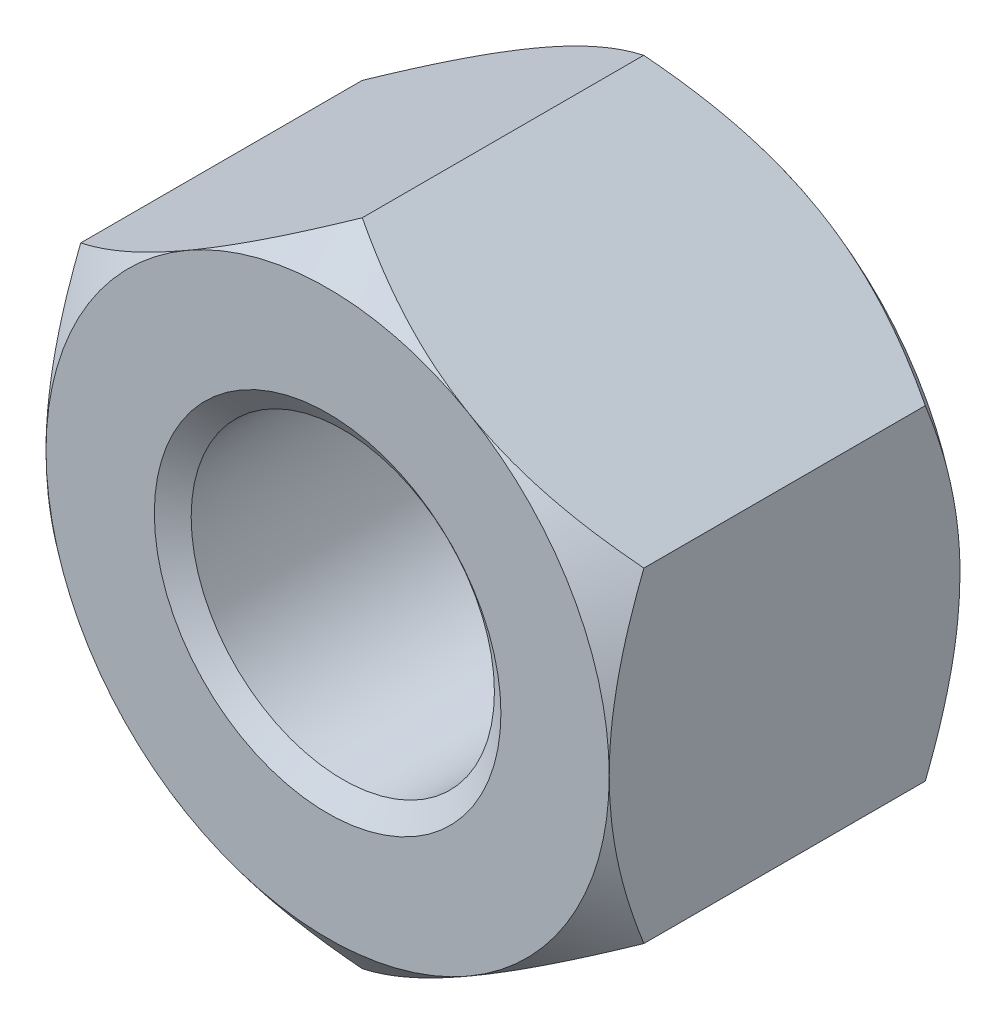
ISO-10303-21;
HEADER;
FILE_DESCRIPTION(('STEP AP214'),'2;1');
FILE_NAME('part.step','',(''),(''),'','','');
FILE_SCHEMA(('AUTOMOTIVE_DESIGN { 1 0 10303 214 1 1 1 1 }'));
ENDSEC;
DATA;
#1=APPLICATION_CONTEXT('core data for automotive mechanical design processes');
#2=APPLICATION_PROTOCOL_DEFINITION('international standard','automotive_design',2000,#1);
#3=PRODUCT_CONTEXT('',#1,'mechanical');
#4=PRODUCT('Part','Part','',(#3));
#5=PRODUCT_RELATED_PRODUCT_CATEGORY('part','',(#4));
#6=PRODUCT_DEFINITION_FORMATION('','',#4);
#7=PRODUCT_DEFINITION_CONTEXT('part definition',#1,'design');
#8=PRODUCT_DEFINITION('design','',#6,#7);
#9=PRODUCT_DEFINITION_SHAPE('','',#8);
#10=(LENGTH_UNIT() NAMED_UNIT(*) SI_UNIT(.MILLI.,.METRE.));
#11=(NAMED_UNIT(*) PLANE_ANGLE_UNIT() SI_UNIT($,.RADIAN.));
#12=(NAMED_UNIT(*) SI_UNIT($,.STERADIAN.) SOLID_ANGLE_UNIT());
#13=UNCERTAINTY_MEASURE_WITH_UNIT(LENGTH_MEASURE(1.E-05),#10,'distance_accuracy_value','');
#14=(GEOMETRIC_REPRESENTATION_CONTEXT(3) GLOBAL_UNCERTAINTY_ASSIGNED_CONTEXT((#13)) GLOBAL_UNIT_ASSIGNED_CONTEXT((#10,
#11,#12)) REPRESENTATION_CONTEXT('',''));
#15=CARTESIAN_POINT('',(0.,0.,0.));
#16=DIRECTION('',(0.,0.,1.));
#17=DIRECTION('',(1.,0.,0.));
#18=AXIS2_PLACEMENT_3D('',#15,#16,#17);
#19=CARTESIAN_POINT('',(0.,0.,-25.7048));
#20=DIRECTION('',(0.,0.,1.));
#21=DIRECTION('',(1.,0.,0.));
#22=AXIS2_PLACEMENT_3D('',#19,#20,#21);
#23=CYLINDRICAL_SURFACE('',#22,11.1125);
#24=CARTESIAN_POINT('',(0.,0.,-1.11157946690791));
#25=DIRECTION('',(0.,0.,1.));
#26=DIRECTION('',(1.,0.,0.));
#27=AXIS2_PLACEMENT_3D('',#24,#25,#26);
#28=CIRCLE('',#27,11.1125);
#29=CARTESIAN_POINT('',(11.1125,0.,-1.11157946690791));
#30=VERTEX_POINT('',#29);
#31=EDGE_CURVE('E180',#30,#30,#28,.F.);
#32=ORIENTED_EDGE('',*,*,#31,.F.);
#33=EDGE_LOOP('',(#32));
#34=FACE_BOUND('',#33,.T.);
#35=CARTESIAN_POINT('',(0.,0.,-24.5678205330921));
#36=DIRECTION('',(0.,0.,-1.));
#37=DIRECTION('',(-1.,0.,0.));
#38=AXIS2_PLACEMENT_3D('',#35,#36,#37);
#39=CIRCLE('',#38,11.1125);
#40=CARTESIAN_POINT('',(-11.1125,0.,-24.5678205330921));
#41=VERTEX_POINT('',#40);
#42=EDGE_CURVE('E44',#41,#41,#39,.F.);
#43=ORIENTED_EDGE('',*,*,#42,.F.);
#44=EDGE_LOOP('',(#43));
#45=FACE_BOUND('',#44,.T.);
#46=ADVANCED_FACE('F39',(#34,#45),#23,.F.);
#47=CARTESIAN_POINT('',(0.,23.8301323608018,-25.7048));
#48=DIRECTION('',(-0.500000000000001,0.866025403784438,0.));
#49=DIRECTION('',(-0.866025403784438,-0.500000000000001,0.));
#50=AXIS2_PLACEMENT_3D('',#47,#48,#49);
#51=PLANE('',#50);
#52=DIRECTION('',(0.,0.,1.));
#53=VECTOR('',#52,1.);
#54=CARTESIAN_POINT('',(-20.6375,11.9150661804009,-25.7048));
#55=LINE('',#54,#53);
#56=CARTESIAN_POINT('',(-20.6375,11.9150661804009,-23.1648));
#57=VERTEX_POINT('',#56);
#58=CARTESIAN_POINT('',(-20.6375,11.9150661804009,-2.53999999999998));
#59=VERTEX_POINT('',#58);
#60=EDGE_CURVE('E170',#57,#59,#55,.T.);
#61=ORIENTED_EDGE('',*,*,#60,.T.);
#62=CARTESIAN_POINT('',(-20.6377,11.914950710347,-2.54009186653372));
#63=CARTESIAN_POINT('',(-20.275187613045,12.1242473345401,-2.3735945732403));
#64=CARTESIAN_POINT('',(-19.9106890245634,12.3346906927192,-2.21273073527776));
#65=CARTESIAN_POINT('',(-19.1775207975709,12.7579855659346,-1.90378856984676));
#66=CARTESIAN_POINT('',(-18.8088498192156,12.9708378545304,-1.7557144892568));
#67=CARTESIAN_POINT('',(-18.0662260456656,13.3995918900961,-1.47354500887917));
#68=CARTESIAN_POINT('',(-17.6922603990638,13.6155010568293,-1.33949446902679));
#69=CARTESIAN_POINT('',(-16.9402681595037,14.0496639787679,-1.08763798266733));
#70=CARTESIAN_POINT('',(-16.5622419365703,14.2679175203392,-0.969830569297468));
#71=CARTESIAN_POINT('',(-15.8058382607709,14.704627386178,-0.753220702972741));
#72=CARTESIAN_POINT('',(-15.4274967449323,14.923062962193,-0.654251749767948));
#73=CARTESIAN_POINT('',(-14.6673819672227,15.3619154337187,-0.475647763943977));
#74=CARTESIAN_POINT('',(-14.2856086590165,15.582332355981,-0.396012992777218));
#75=CARTESIAN_POINT('',(-13.5196710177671,16.0245466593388,-0.25768087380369));
#76=CARTESIAN_POINT('',(-13.1355100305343,16.2463421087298,-0.198958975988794));
#77=CARTESIAN_POINT('',(-12.365131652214,16.6911202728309,-0.103554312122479));
#78=CARTESIAN_POINT('',(-11.9789142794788,16.9141029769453,-0.066871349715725));
#79=CARTESIAN_POINT('',(-11.1993126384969,17.3642061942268,-0.0159748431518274));
#80=CARTESIAN_POINT('',(-10.8059106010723,17.5913369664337,-0.00212096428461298));
#81=CARTESIAN_POINT('',(-10.0190181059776,18.0456495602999,0.00166954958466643));
#82=CARTESIAN_POINT('',(-9.62552764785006,18.2728313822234,-0.00839394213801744));
#83=CARTESIAN_POINT('',(-8.83935351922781,18.7267292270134,-0.0522061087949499));
#84=CARTESIAN_POINT('',(-8.4466703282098,18.9534449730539,-0.0859661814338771));
#85=CARTESIAN_POINT('',(-7.66330095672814,19.4057234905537,-0.176393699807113));
#86=CARTESIAN_POINT('',(-7.27261478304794,19.6312862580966,-0.2330612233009));
#87=CARTESIAN_POINT('',(-6.49408280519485,20.0807719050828,-0.368063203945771));
#88=CARTESIAN_POINT('',(-6.10623692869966,20.3046948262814,-0.446397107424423));
#89=CARTESIAN_POINT('',(-5.33402957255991,20.7505289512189,-0.6231628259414));
#90=CARTESIAN_POINT('',(-4.94966816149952,20.9724401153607,-0.721595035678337));
#91=CARTESIAN_POINT('',(-3.80265971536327,21.6346657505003,-1.04439097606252));
#92=CARTESIAN_POINT('',(-3.04573810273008,22.0716746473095,-1.29631764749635));
#93=CARTESIAN_POINT('',(-1.90947060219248,22.7276989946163,-1.72370675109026));
#94=CARTESIAN_POINT('',(-1.52379699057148,22.950367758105,-1.8775848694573));
#95=CARTESIAN_POINT('',(-0.757992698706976,23.3925050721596,-2.19898642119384));
#96=CARTESIAN_POINT('',(-0.377849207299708,23.6119810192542,-2.3664690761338));
#97=CARTESIAN_POINT('',(0.000199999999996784,23.8302478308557,-2.54009186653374));
#98=B_SPLINE_CURVE_WITH_KNOTS('',3,(#62,#63,#64,#65,#66,#67,#68,#69,#70,#71,#72,#73,#74,#75,#76,
#77,#78,#79,#80,#81,#82,#83,#84,#85,#86,#87,#88,#89,#90,#91,#92,#93,#94,#95,#96,#97),
.UNSPECIFIED.,.F.,.F.,(4,2,2,2,2,2,2,2,2,2,2,2,2,2,2,2,2,4),(0.,1.35150330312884,
2.70345366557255,4.05960442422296,5.41563263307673,6.75905435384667,8.10249424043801,
9.44435179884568,10.7861974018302,12.1489880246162,13.5117858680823,14.8752396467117,
16.2386980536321,17.6021216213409,18.9655719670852,21.6912480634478,23.1045997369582,
24.5138611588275),.UNSPECIFIED.);
#99=CARTESIAN_POINT('',(-10.31875,17.8725992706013,0.));
#100=VERTEX_POINT('',#99);
#101=EDGE_CURVE('E66',#59,#100,#98,.T.);
#102=ORIENTED_EDGE('',*,*,#101,.T.);
#103=CARTESIAN_POINT('',(0.,23.8301323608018,-2.54));
#104=VERTEX_POINT('',#103);
#105=EDGE_CURVE('E249',#100,#104,#98,.T.);
#106=ORIENTED_EDGE('',*,*,#105,.T.);
#107=DIRECTION('',(0.,0.,1.));
#108=VECTOR('',#107,1.);
#109=CARTESIAN_POINT('',(0.,23.8301323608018,-25.7048));
#110=LINE('',#109,#108);
#111=CARTESIAN_POINT('',(0.,23.8301323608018,-23.1648));
#112=VERTEX_POINT('',#111);
#113=EDGE_CURVE('E155',#112,#104,#110,.T.);
#114=ORIENTED_EDGE('',*,*,#113,.F.);
#115=CARTESIAN_POINT('',(-20.6377,11.914950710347,-23.1647081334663));
#116=CARTESIAN_POINT('',(-20.275187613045,12.1242473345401,-23.3312054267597));
#117=CARTESIAN_POINT('',(-19.9106890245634,12.3346906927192,-23.4920692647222));
#118=CARTESIAN_POINT('',(-19.1775207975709,12.7579855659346,-23.8010114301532));
#119=CARTESIAN_POINT('',(-18.8088498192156,12.9708378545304,-23.9490855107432));
#120=CARTESIAN_POINT('',(-18.0662260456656,13.3995918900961,-24.2312549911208));
#121=CARTESIAN_POINT('',(-17.6922603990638,13.6155010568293,-24.3653055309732));
#122=CARTESIAN_POINT('',(-16.9402681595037,14.0496639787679,-24.6171620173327));
#123=CARTESIAN_POINT('',(-16.5622419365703,14.2679175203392,-24.7349694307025));
#124=CARTESIAN_POINT('',(-15.8058382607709,14.704627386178,-24.9515792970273));
#125=CARTESIAN_POINT('',(-15.4274967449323,14.923062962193,-25.0505482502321));
#126=CARTESIAN_POINT('',(-14.6673819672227,15.3619154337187,-25.229152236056));
#127=CARTESIAN_POINT('',(-14.2856086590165,15.582332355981,-25.3087870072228));
#128=CARTESIAN_POINT('',(-13.5196710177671,16.0245466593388,-25.4471191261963));
#129=CARTESIAN_POINT('',(-13.1355100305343,16.2463421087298,-25.5058410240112));
#130=CARTESIAN_POINT('',(-12.365131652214,16.6911202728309,-25.6012456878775));
#131=CARTESIAN_POINT('',(-11.9789142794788,16.9141029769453,-25.6379286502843));
#132=CARTESIAN_POINT('',(-11.1993126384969,17.3642061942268,-25.6888251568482));
#133=CARTESIAN_POINT('',(-10.8059106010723,17.5913369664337,-25.7026790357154));
#134=CARTESIAN_POINT('',(-10.0190181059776,18.0456495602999,-25.7064695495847));
#135=CARTESIAN_POINT('',(-9.62552764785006,18.2728313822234,-25.696406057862));
#136=CARTESIAN_POINT('',(-8.83935351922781,18.7267292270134,-25.6525938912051));
#137=CARTESIAN_POINT('',(-8.44667032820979,18.9534449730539,-25.6188338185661));
#138=CARTESIAN_POINT('',(-7.66330095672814,19.4057234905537,-25.5284063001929));
#139=CARTESIAN_POINT('',(-7.27261478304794,19.6312862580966,-25.4717387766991));
#140=CARTESIAN_POINT('',(-6.49408280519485,20.0807719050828,-25.3367367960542));
#141=CARTESIAN_POINT('',(-6.10623692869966,20.3046948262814,-25.2584028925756));
#142=CARTESIAN_POINT('',(-5.33402957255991,20.7505289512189,-25.0816371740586));
#143=CARTESIAN_POINT('',(-4.94966816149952,20.9724401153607,-24.9832049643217));
#144=CARTESIAN_POINT('',(-3.80265971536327,21.6346657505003,-24.6604090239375));
#145=CARTESIAN_POINT('',(-3.04573810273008,22.0716746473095,-24.4084823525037));
#146=CARTESIAN_POINT('',(-1.90947060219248,22.7276989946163,-23.9810932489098));
#147=CARTESIAN_POINT('',(-1.52379699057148,22.950367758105,-23.8272151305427));
#148=CARTESIAN_POINT('',(-0.757992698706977,23.3925050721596,-23.5058135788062));
#149=CARTESIAN_POINT('',(-0.377849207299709,23.6119810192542,-23.3383309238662));
#150=CARTESIAN_POINT('',(0.000199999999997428,23.8302478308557,-23.1647081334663));
#151=B_SPLINE_CURVE_WITH_KNOTS('',3,(#115,#116,#117,#118,#119,#120,#121,#122,#123,#124,#125,
#126,#127,#128,#129,#130,#131,#132,#133,#134,#135,#136,#137,#138,#139,#140,#141,#142,#143,#144,
#145,#146,#147,#148,#149,#150),.UNSPECIFIED.,.F.,.F.,(4,2,2,2,2,2,2,2,2,2,2,2,2,2,2,2,2,4),(0.,
1.35150330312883,2.70345366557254,4.05960442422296,5.41563263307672,6.75905435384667,
8.102494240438,9.44435179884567,10.7861974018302,12.1489880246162,13.5117858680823,
14.8752396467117,16.2386980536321,17.6021216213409,18.9655719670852,21.6912480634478,
23.1045997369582,24.5138611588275),.UNSPECIFIED.);
#152=CARTESIAN_POINT('',(-10.31875,17.8725992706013,-25.7048));
#153=VERTEX_POINT('',#152);
#154=EDGE_CURVE('E173',#153,#112,#151,.T.);
#155=ORIENTED_EDGE('',*,*,#154,.F.);
#156=EDGE_CURVE('E272',#57,#153,#151,.T.);
#157=ORIENTED_EDGE('',*,*,#156,.F.);
#158=EDGE_LOOP('',(#61,#102,#106,#114,#155,#157));
#159=FACE_BOUND('',#158,.T.);
#160=ADVANCED_FACE('F41',(#159),#51,.T.);
#161=CARTESIAN_POINT('',(20.6375,11.9150661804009,-25.7048));
#162=DIRECTION('',(0.500000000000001,0.866025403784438,0.));
#163=DIRECTION('',(-0.866025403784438,0.500000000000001,0.));
#164=AXIS2_PLACEMENT_3D('',#161,#162,#163);
#165=PLANE('',#164);
#166=ORIENTED_EDGE('',*,*,#113,.T.);
#167=CARTESIAN_POINT('',(-0.000200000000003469,23.8302478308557,-2.54009186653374));
#168=CARTESIAN_POINT('',(0.362312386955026,23.6209512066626,-2.37359457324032));
#169=CARTESIAN_POINT('',(0.726810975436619,23.4105078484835,-2.21273073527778));
#170=CARTESIAN_POINT('',(1.45997920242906,22.9872129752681,-1.90378856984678));
#171=CARTESIAN_POINT('',(1.8286501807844,22.7743606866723,-1.75571448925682));
#172=CARTESIAN_POINT('',(2.57127395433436,22.3456066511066,-1.47354500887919));
#173=CARTESIAN_POINT('',(2.94523960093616,22.1296974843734,-1.3394944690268));
#174=CARTESIAN_POINT('',(3.69723184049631,21.6955345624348,-1.08763798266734));
#175=CARTESIAN_POINT('',(4.07525806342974,21.4772810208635,-0.969830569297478));
#176=CARTESIAN_POINT('',(4.83166173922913,21.0405711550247,-0.75322070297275));
#177=CARTESIAN_POINT('',(5.21000325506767,20.8221355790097,-0.654251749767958));
#178=CARTESIAN_POINT('',(5.97011803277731,20.383283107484,-0.475647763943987));
#179=CARTESIAN_POINT('',(6.35189134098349,20.1628661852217,-0.396012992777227));
#180=CARTESIAN_POINT('',(7.11782898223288,19.7206518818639,-0.257680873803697));
#181=CARTESIAN_POINT('',(7.50198996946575,19.4988564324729,-0.1989589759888));
#182=CARTESIAN_POINT('',(8.27236834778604,19.0540782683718,-0.103554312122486));
#183=CARTESIAN_POINT('',(8.65858572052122,18.8310955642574,-0.0668713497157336));
#184=CARTESIAN_POINT('',(9.4381873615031,18.3809923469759,-0.0159748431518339));
#185=CARTESIAN_POINT('',(9.83158939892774,18.153861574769,-0.00212096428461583));
#186=CARTESIAN_POINT('',(10.6184818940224,17.6995489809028,0.00166954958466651));
#187=CARTESIAN_POINT('',(11.01197235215,17.4723671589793,-0.00839394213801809));
#188=CARTESIAN_POINT('',(11.7981464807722,17.0184693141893,-0.0522061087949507));
#189=CARTESIAN_POINT('',(12.1908296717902,16.7917535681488,-0.0859661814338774));
#190=CARTESIAN_POINT('',(12.9741990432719,16.339475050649,-0.176393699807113));
#191=CARTESIAN_POINT('',(13.3648852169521,16.1139122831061,-0.2330612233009));
#192=CARTESIAN_POINT('',(14.1434171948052,15.6644266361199,-0.368063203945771));
#193=CARTESIAN_POINT('',(14.5312630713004,15.4405037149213,-0.446397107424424));
#194=CARTESIAN_POINT('',(15.3034704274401,14.9946695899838,-0.623162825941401));
#195=CARTESIAN_POINT('',(15.6878318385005,14.7727584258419,-0.721595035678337));
#196=CARTESIAN_POINT('',(16.8348402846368,14.1105327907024,-1.04439097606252));
#197=CARTESIAN_POINT('',(17.59176189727,13.6735238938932,-1.29631764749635));
#198=CARTESIAN_POINT('',(18.7280293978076,13.0174995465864,-1.72370675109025));
#199=CARTESIAN_POINT('',(19.1137030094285,12.7948307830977,-1.8775848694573));
#200=CARTESIAN_POINT('',(19.879507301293,12.3526934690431,-2.19898642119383));
#201=CARTESIAN_POINT('',(20.2596507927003,12.1332175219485,-2.36646907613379));
#202=CARTESIAN_POINT('',(20.6377,11.9149507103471,-2.54009186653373));
#203=B_SPLINE_CURVE_WITH_KNOTS('',3,(#167,#168,#169,#170,#171,#172,#173,#174,#175,#176,#177,
#178,#179,#180,#181,#182,#183,#184,#185,#186,#187,#188,#189,#190,#191,#192,#193,#194,#195,#196,
#197,#198,#199,#200,#201,#202),.UNSPECIFIED.,.F.,.F.,(4,2,2,2,2,2,2,2,2,2,2,2,2,2,2,2,2,4),(0.,
1.35150330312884,2.70345366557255,4.05960442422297,5.41563263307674,6.75905435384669,
8.10249424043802,9.44435179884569,10.7861974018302,12.1489880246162,13.5117858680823,
14.8752396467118,16.2386980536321,17.602121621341,18.9655719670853,21.6912480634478,
23.1045997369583,24.5138611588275),.UNSPECIFIED.);
#204=CARTESIAN_POINT('',(10.31875,17.8725992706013,0.));
#205=VERTEX_POINT('',#204);
#206=EDGE_CURVE('E148',#104,#205,#203,.T.);
#207=ORIENTED_EDGE('',*,*,#206,.T.);
#208=CARTESIAN_POINT('',(20.6375,11.9150661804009,-2.54));
#209=VERTEX_POINT('',#208);
#210=EDGE_CURVE('E134',#205,#209,#203,.T.);
#211=ORIENTED_EDGE('',*,*,#210,.T.);
#212=DIRECTION('',(0.,0.,1.));
#213=VECTOR('',#212,1.);
#214=CARTESIAN_POINT('',(20.6375,11.9150661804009,-25.7048));
#215=LINE('',#214,#213);
#216=CARTESIAN_POINT('',(20.6375,11.9150661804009,-23.1648));
#217=VERTEX_POINT('',#216);
#218=EDGE_CURVE('E147',#217,#209,#215,.T.);
#219=ORIENTED_EDGE('',*,*,#218,.F.);
#220=CARTESIAN_POINT('',(-0.000200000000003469,23.8302478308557,-23.1647081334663));
#221=CARTESIAN_POINT('',(0.362312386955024,23.6209512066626,-23.3312054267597));
#222=CARTESIAN_POINT('',(0.726810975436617,23.4105078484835,-23.4920692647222));
#223=CARTESIAN_POINT('',(1.45997920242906,22.9872129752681,-23.8010114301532));
#224=CARTESIAN_POINT('',(1.8286501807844,22.7743606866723,-23.9490855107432));
#225=CARTESIAN_POINT('',(2.57127395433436,22.3456066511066,-24.2312549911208));
#226=CARTESIAN_POINT('',(2.94523960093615,22.1296974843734,-24.3653055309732));
#227=CARTESIAN_POINT('',(3.6972318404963,21.6955345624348,-24.6171620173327));
#228=CARTESIAN_POINT('',(4.07525806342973,21.4772810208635,-24.7349694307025));
#229=CARTESIAN_POINT('',(4.83166173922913,21.0405711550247,-24.9515792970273));
#230=CARTESIAN_POINT('',(5.21000325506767,20.8221355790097,-25.050548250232));
#231=CARTESIAN_POINT('',(5.97011803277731,20.383283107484,-25.229152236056));
#232=CARTESIAN_POINT('',(6.35189134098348,20.1628661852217,-25.3087870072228));
#233=CARTESIAN_POINT('',(7.11782898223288,19.7206518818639,-25.4471191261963));
#234=CARTESIAN_POINT('',(7.50198996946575,19.4988564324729,-25.5058410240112));
#235=CARTESIAN_POINT('',(8.27236834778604,19.0540782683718,-25.6012456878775));
#236=CARTESIAN_POINT('',(8.65858572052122,18.8310955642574,-25.6379286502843));
#237=CARTESIAN_POINT('',(9.4381873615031,18.3809923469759,-25.6888251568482));
#238=CARTESIAN_POINT('',(9.83158939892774,18.153861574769,-25.7026790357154));
#239=CARTESIAN_POINT('',(10.6184818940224,17.6995489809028,-25.7064695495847));
#240=CARTESIAN_POINT('',(11.01197235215,17.4723671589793,-25.696406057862));
#241=CARTESIAN_POINT('',(11.7981464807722,17.0184693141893,-25.6525938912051));
#242=CARTESIAN_POINT('',(12.1908296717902,16.7917535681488,-25.6188338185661));
#243=CARTESIAN_POINT('',(12.9741990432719,16.339475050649,-25.5284063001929));
#244=CARTESIAN_POINT('',(13.3648852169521,16.1139122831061,-25.4717387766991));
#245=CARTESIAN_POINT('',(14.1434171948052,15.6644266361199,-25.3367367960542));
#246=CARTESIAN_POINT('',(14.5312630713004,15.4405037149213,-25.2584028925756));
#247=CARTESIAN_POINT('',(15.3034704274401,14.9946695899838,-25.0816371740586));
#248=CARTESIAN_POINT('',(15.6878318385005,14.772758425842,-24.9832049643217));
#249=CARTESIAN_POINT('',(16.8348402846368,14.1105327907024,-24.6604090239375));
#250=CARTESIAN_POINT('',(17.5917618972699,13.6735238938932,-24.4084823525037));
#251=CARTESIAN_POINT('',(18.7280293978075,13.0174995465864,-23.9810932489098));
#252=CARTESIAN_POINT('',(19.1137030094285,12.7948307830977,-23.8272151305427));
#253=CARTESIAN_POINT('',(19.879507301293,12.3526934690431,-23.5058135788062));
#254=CARTESIAN_POINT('',(20.2596507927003,12.1332175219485,-23.3383309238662));
#255=CARTESIAN_POINT('',(20.6377,11.9149507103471,-23.1647081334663));
#256=B_SPLINE_CURVE_WITH_KNOTS('',3,(#220,#221,#222,#223,#224,#225,#226,#227,#228,#229,#230,
#231,#232,#233,#234,#235,#236,#237,#238,#239,#240,#241,#242,#243,#244,#245,#246,#247,#248,#249,
#250,#251,#252,#253,#254,#255),.UNSPECIFIED.,.F.,.F.,(4,2,2,2,2,2,2,2,2,2,2,2,2,2,2,2,2,4),(0.,
1.35150330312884,2.70345366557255,4.05960442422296,5.41563263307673,6.75905435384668,
8.10249424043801,9.44435179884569,10.7861974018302,12.1489880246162,13.5117858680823,
14.8752396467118,16.2386980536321,17.602121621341,18.9655719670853,21.6912480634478,
23.1045997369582,24.5138611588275),.UNSPECIFIED.);
#257=CARTESIAN_POINT('',(10.31875,17.8725992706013,-25.7048));
#258=VERTEX_POINT('',#257);
#259=EDGE_CURVE('E265',#258,#217,#256,.T.);
#260=ORIENTED_EDGE('',*,*,#259,.F.);
#261=EDGE_CURVE('E271',#112,#258,#256,.T.);
#262=ORIENTED_EDGE('',*,*,#261,.F.);
#263=EDGE_LOOP('',(#166,#207,#211,#219,#260,#262));
#264=FACE_BOUND('',#263,.T.);
#265=ADVANCED_FACE('F145',(#264),#165,.T.);
#266=CARTESIAN_POINT('',(20.6375,11.9150661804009,-25.7048));
#267=DIRECTION('',(-1.,0.,0.));
#268=DIRECTION('',(0.,-1.,0.));
#269=AXIS2_PLACEMENT_3D('',#266,#267,#268);
#270=PLANE('',#269);
#271=CARTESIAN_POINT('',(20.6375,-27.3310068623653,-10.8278568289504));
#272=CARTESIAN_POINT('',(20.6375,-26.9764041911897,-10.6027203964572));
#273=CARTESIAN_POINT('',(20.6375,-26.6210859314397,-10.3787117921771));
#274=CARTESIAN_POINT('',(20.6375,-25.9088880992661,-9.93317931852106));
#275=CARTESIAN_POINT('',(20.6375,-25.552008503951,-9.71165548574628));
#276=CARTESIAN_POINT('',(20.6375,-24.4787066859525,-9.05107757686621));
#277=CARTESIAN_POINT('',(20.6375,-23.7597615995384,-8.61610632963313));
#278=CARTESIAN_POINT('',(20.6375,-22.309097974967,-7.75647970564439));
#279=CARTESIAN_POINT('',(20.6375,-21.5773258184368,-7.33191460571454));
#280=CARTESIAN_POINT('',(20.6375,-20.1044765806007,-6.49929204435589));
#281=CARTESIAN_POINT('',(20.6375,-19.3634000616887,-6.09123359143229));
#282=CARTESIAN_POINT('',(20.6375,-17.8336682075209,-5.27603670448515));
#283=CARTESIAN_POINT('',(20.6375,-17.0444625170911,-4.8699258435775));
#284=CARTESIAN_POINT('',(20.6375,-15.4518309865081,-4.08611717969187));
#285=CARTESIAN_POINT('',(20.6375,-14.6484032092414,-3.70842328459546));
#286=CARTESIAN_POINT('',(20.6375,-13.027440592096,-2.99025429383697));
#287=CARTESIAN_POINT('',(20.6375,-12.209947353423,-2.64968596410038));
#288=CARTESIAN_POINT('',(20.6375,-10.5572902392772,-2.01465523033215));
#289=CARTESIAN_POINT('',(20.6375,-9.72213334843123,-1.72017497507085));
#290=CARTESIAN_POINT('',(20.6375,-8.45298549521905,-1.32117737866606));
#291=CARTESIAN_POINT('',(20.6375,-8.02577859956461,-1.19495715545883));
#292=CARTESIAN_POINT('',(20.6375,-7.16684068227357,-0.958908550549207));
#293=CARTESIAN_POINT('',(20.6375,-6.73510979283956,-0.849079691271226));
#294=CARTESIAN_POINT('',(20.6375,-5.86742319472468,-0.647493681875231));
#295=CARTESIAN_POINT('',(20.6375,-5.43146741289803,-0.555736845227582));
#296=CARTESIAN_POINT('',(20.6375,-4.55587783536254,-0.391909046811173));
#297=CARTESIAN_POINT('',(20.6375,-4.11624426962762,-0.319836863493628));
#298=CARTESIAN_POINT('',(20.6375,-3.24174184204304,-0.197859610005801));
#299=CARTESIAN_POINT('',(20.6375,-2.806924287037,-0.147588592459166));
#300=CARTESIAN_POINT('',(20.6375,-1.9353364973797,-0.0684405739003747));
#301=CARTESIAN_POINT('',(20.6375,-1.49856627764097,-0.0395634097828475));
#302=CARTESIAN_POINT('',(20.6375,-0.624142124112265,-0.00383377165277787));
#303=CARTESIAN_POINT('',(20.6375,-0.186488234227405,0.00301977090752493));
#304=CARTESIAN_POINT('',(20.6375,0.688600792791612,-0.00544947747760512));
#305=CARTESIAN_POINT('',(20.6375,1.12603593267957,-0.0207719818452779));
#306=CARTESIAN_POINT('',(20.6375,1.96675880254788,-0.0712758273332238));
#307=CARTESIAN_POINT('',(20.6375,2.37014278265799,-0.104878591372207));
#308=CARTESIAN_POINT('',(20.6375,3.17498456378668,-0.190136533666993));
#309=CARTESIAN_POINT('',(20.6375,3.57644239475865,-0.241791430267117));
#310=CARTESIAN_POINT('',(20.6375,4.3767759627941,-0.362264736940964));
#311=CARTESIAN_POINT('',(20.6375,4.77565160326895,-0.431083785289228));
#312=CARTESIAN_POINT('',(20.6375,5.57028429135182,-0.58479286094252));
#313=CARTESIAN_POINT('',(20.6375,5.96604130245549,-0.669683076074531));
#314=CARTESIAN_POINT('',(20.6375,6.76173880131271,-0.856120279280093));
#315=CARTESIAN_POINT('',(20.6375,7.16161052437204,-0.957959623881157));
#316=CARTESIAN_POINT('',(20.6375,7.9574805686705,-1.17574255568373));
#317=CARTESIAN_POINT('',(20.6375,8.35347886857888,-1.29168622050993));
#318=CARTESIAN_POINT('',(20.6375,9.14142015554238,-1.53632483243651));
#319=CARTESIAN_POINT('',(20.6375,9.53336391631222,-1.66501729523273));
#320=CARTESIAN_POINT('',(20.6375,10.3132623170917,-1.93389740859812));
#321=CARTESIAN_POINT('',(20.6375,10.7012170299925,-2.07408484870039));
#322=CARTESIAN_POINT('',(20.6375,11.7633483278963,-2.47399113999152));
#323=CARTESIAN_POINT('',(20.6375,12.4335234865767,-2.74436702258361));
#324=CARTESIAN_POINT('',(20.6375,13.7628599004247,-3.31109144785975));
#325=CARTESIAN_POINT('',(20.6375,14.4220187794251,-3.60744550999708));
#326=CARTESIAN_POINT('',(20.6375,15.7308411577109,-4.22168083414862));
#327=CARTESIAN_POINT('',(20.6375,16.3804965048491,-4.53957939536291));
#328=CARTESIAN_POINT('',(20.6375,17.6708554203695,-5.1928770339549));
#329=CARTESIAN_POINT('',(20.6375,18.3115595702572,-5.52827496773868));
#330=CARTESIAN_POINT('',(20.6375,19.5880109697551,-6.2150924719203));
#331=CARTESIAN_POINT('',(20.6375,20.2237230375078,-6.56657722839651));
#332=CARTESIAN_POINT('',(20.6375,21.4882685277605,-7.28169881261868));
#333=CARTESIAN_POINT('',(20.6375,22.1171018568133,-7.64533580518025));
#334=CARTESIAN_POINT('',(20.6375,23.3685028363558,-8.38262626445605));
#335=CARTESIAN_POINT('',(20.6375,23.9910729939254,-8.75627548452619));
#336=CARTESIAN_POINT('',(20.6375,25.2309760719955,-9.51214217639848));
#337=CARTESIAN_POINT('',(20.6375,25.8483090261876,-9.89435959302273));
#338=CARTESIAN_POINT('',(20.6375,27.022582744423,-10.631056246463));
#339=CARTESIAN_POINT('',(20.6375,27.5799197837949,-10.9849047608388));
#340=CARTESIAN_POINT('',(20.6375,28.6912411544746,-11.6978314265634));
#341=CARTESIAN_POINT('',(20.6375,29.2452254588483,-12.0569096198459));
#342=CARTESIAN_POINT('',(20.6375,30.902831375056,-13.1410247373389));
#343=CARTESIAN_POINT('',(20.6375,32.0020009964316,-13.8728759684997));
#344=CARTESIAN_POINT('',(20.6375,33.6381714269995,-14.9774566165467));
#345=CARTESIAN_POINT('',(20.6375,34.1787567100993,-15.3449056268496));
#346=CARTESIAN_POINT('',(20.6375,35.257836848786,-16.0828655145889));
#347=CARTESIAN_POINT('',(20.6375,35.7963317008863,-16.4533763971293));
#348=CARTESIAN_POINT('',(20.6375,36.8713310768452,-17.1970380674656));
#349=CARTESIAN_POINT('',(20.6375,37.4078359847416,-17.5701883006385));
#350=CARTESIAN_POINT('',(20.6375,38.4791400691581,-18.3189207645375));
#351=CARTESIAN_POINT('',(20.6375,39.0139392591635,-18.6945029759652));
#352=CARTESIAN_POINT('',(20.6375,39.5479768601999,-19.0711627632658));
#353=B_SPLINE_CURVE_WITH_KNOTS('',3,(#271,#272,#273,#274,#275,#276,#277,#278,#279,#280,#281,
#282,#283,#284,#285,#286,#287,#288,#289,#290,#291,#292,#293,#294,#295,#296,#297,#298,#299,#300,
#301,#302,#303,#304,#305,#306,#307,#308,#309,#310,#311,#312,#313,#314,#315,#316,#317,#318,#319,
#320,#321,#322,#323,#324,#325,#326,#327,#328,#329,#330,#331,#332,#333,#334,#335,#336,#337,#338,
#339,#340,#341,#342,#343,#344,#345,#346,#347,#348,#349,#350,#351,#352),.UNSPECIFIED.,.F.,.F.,(4,
2,2,2,2,2,2,2,2,2,2,2,2,2,2,2,2,2,2,2,2,2,2,2,2,2,2,2,2,2,2,2,2,2,2,2,2,2,2,2,4),(0.,
1.26010130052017,2.52022113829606,5.04095926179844,7.57884086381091,10.1165697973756,
12.7788175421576,15.4414307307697,18.0971952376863,20.7519285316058,22.0880503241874,
23.4241331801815,24.7602392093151,26.0962623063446,27.4088985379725,28.7215247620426,
30.0340872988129,31.3466328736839,32.5605613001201,33.7744707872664,34.9884254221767,
36.2023942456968,37.4400199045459,38.677652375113,39.9150441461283,41.1524132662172,
43.319660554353,45.4873694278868,47.656839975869,49.8261689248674,52.0052399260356,
54.1843404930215,56.3625309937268,58.5407074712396,60.5212046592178,62.5017177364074,
66.4631162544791,68.4240443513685,70.3849757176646,72.3455065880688,74.3060219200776),.UNSPECIFIED.);
#354=CARTESIAN_POINT('',(20.6375,-11.9150661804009,-2.54));
#355=VERTEX_POINT('',#354);
#356=CARTESIAN_POINT('',(20.6375,0.,0.));
#357=VERTEX_POINT('',#356);
#358=EDGE_CURVE('E140',#355,#357,#353,.T.);
#359=ORIENTED_EDGE('',*,*,#358,.F.);
#360=DIRECTION('',(0.,0.,1.));
#361=VECTOR('',#360,1.);
#362=CARTESIAN_POINT('',(20.6375,-11.9150661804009,-25.7048));
#363=LINE('',#362,#361);
#364=CARTESIAN_POINT('',(20.6375,-11.9150661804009,-23.1648));
#365=VERTEX_POINT('',#364);
#366=EDGE_CURVE('E156',#365,#355,#363,.T.);
#367=ORIENTED_EDGE('',*,*,#366,.F.);
#368=CARTESIAN_POINT('',(20.6375,-27.3310068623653,-14.8769431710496));
#369=CARTESIAN_POINT('',(20.6375,-26.9764041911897,-15.1020796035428));
#370=CARTESIAN_POINT('',(20.6375,-26.6210859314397,-15.3260882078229));
#371=CARTESIAN_POINT('',(20.6375,-25.9088880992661,-15.7716206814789));
#372=CARTESIAN_POINT('',(20.6375,-25.552008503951,-15.9931445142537));
#373=CARTESIAN_POINT('',(20.6375,-24.4787066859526,-16.6537224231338));
#374=CARTESIAN_POINT('',(20.6375,-23.7597615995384,-17.0886936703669));
#375=CARTESIAN_POINT('',(20.6375,-22.3090979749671,-17.9483202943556));
#376=CARTESIAN_POINT('',(20.6375,-21.5773258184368,-18.3728853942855));
#377=CARTESIAN_POINT('',(20.6375,-20.1044765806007,-19.2055079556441));
#378=CARTESIAN_POINT('',(20.6375,-19.3634000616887,-19.6135664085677));
#379=CARTESIAN_POINT('',(20.6375,-17.8336682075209,-20.4287632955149));
#380=CARTESIAN_POINT('',(20.6375,-17.0444625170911,-20.8348741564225));
#381=CARTESIAN_POINT('',(20.6375,-15.4518309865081,-21.6186828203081));
#382=CARTESIAN_POINT('',(20.6375,-14.6484032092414,-21.9963767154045));
#383=CARTESIAN_POINT('',(20.6375,-13.027440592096,-22.714545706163));
#384=CARTESIAN_POINT('',(20.6375,-12.209947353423,-23.0551140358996));
#385=CARTESIAN_POINT('',(20.6375,-10.5572902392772,-23.6901447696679));
#386=CARTESIAN_POINT('',(20.6375,-9.72213334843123,-23.9846250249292));
#387=CARTESIAN_POINT('',(20.6375,-8.45298549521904,-24.3836226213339));
#388=CARTESIAN_POINT('',(20.6375,-8.02577859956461,-24.5098428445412));
#389=CARTESIAN_POINT('',(20.6375,-7.16684068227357,-24.7458914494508));
#390=CARTESIAN_POINT('',(20.6375,-6.73510979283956,-24.8557203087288));
#391=CARTESIAN_POINT('',(20.6375,-5.86742319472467,-25.0573063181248));
#392=CARTESIAN_POINT('',(20.6375,-5.43146741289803,-25.1490631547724));
#393=CARTESIAN_POINT('',(20.6375,-4.55587783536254,-25.3128909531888));
#394=CARTESIAN_POINT('',(20.6375,-4.11624426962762,-25.3849631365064));
#395=CARTESIAN_POINT('',(20.6375,-3.24174184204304,-25.5069403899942));
#396=CARTESIAN_POINT('',(20.6375,-2.80692428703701,-25.5572114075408));
#397=CARTESIAN_POINT('',(20.6375,-1.9353364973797,-25.6363594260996));
#398=CARTESIAN_POINT('',(20.6375,-1.49856627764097,-25.6652365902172));
#399=CARTESIAN_POINT('',(20.6375,-0.624142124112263,-25.7009662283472));
#400=CARTESIAN_POINT('',(20.6375,-0.186488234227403,-25.7078197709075));
#401=CARTESIAN_POINT('',(20.6375,0.688600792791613,-25.6993505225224));
#402=CARTESIAN_POINT('',(20.6375,1.12603593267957,-25.6840280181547));
#403=CARTESIAN_POINT('',(20.6375,1.96675880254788,-25.6335241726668));
#404=CARTESIAN_POINT('',(20.6375,2.370142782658,-25.5999214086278));
#405=CARTESIAN_POINT('',(20.6375,3.17498456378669,-25.514663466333));
#406=CARTESIAN_POINT('',(20.6375,3.57644239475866,-25.4630085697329));
#407=CARTESIAN_POINT('',(20.6375,4.37677596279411,-25.342535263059));
#408=CARTESIAN_POINT('',(20.6375,4.77565160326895,-25.2737162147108));
#409=CARTESIAN_POINT('',(20.6375,5.57028429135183,-25.1200071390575));
#410=CARTESIAN_POINT('',(20.6375,5.96604130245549,-25.0351169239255));
#411=CARTESIAN_POINT('',(20.6375,6.76173880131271,-24.8486797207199));
#412=CARTESIAN_POINT('',(20.6375,7.16161052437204,-24.7468403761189));
#413=CARTESIAN_POINT('',(20.6375,7.95748056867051,-24.5290574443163));
#414=CARTESIAN_POINT('',(20.6375,8.35347886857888,-24.4131137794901));
#415=CARTESIAN_POINT('',(20.6375,9.14142015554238,-24.1684751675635));
#416=CARTESIAN_POINT('',(20.6375,9.53336391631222,-24.0397827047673));
#417=CARTESIAN_POINT('',(20.6375,10.3132623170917,-23.7709025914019));
#418=CARTESIAN_POINT('',(20.6375,10.7012170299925,-23.6307151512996));
#419=CARTESIAN_POINT('',(20.6375,11.7633483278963,-23.2308088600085));
#420=CARTESIAN_POINT('',(20.6375,12.4335234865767,-22.9604329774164));
#421=CARTESIAN_POINT('',(20.6375,13.7628599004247,-22.3937085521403));
#422=CARTESIAN_POINT('',(20.6375,14.4220187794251,-22.0973544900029));
#423=CARTESIAN_POINT('',(20.6375,15.7308411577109,-21.4831191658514));
#424=CARTESIAN_POINT('',(20.6375,16.3804965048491,-21.1652206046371));
#425=CARTESIAN_POINT('',(20.6375,17.6708554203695,-20.5119229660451));
#426=CARTESIAN_POINT('',(20.6375,18.3115595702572,-20.1765250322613));
#427=CARTESIAN_POINT('',(20.6375,19.5880109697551,-19.4897075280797));
#428=CARTESIAN_POINT('',(20.6375,20.2237230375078,-19.1382227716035));
#429=CARTESIAN_POINT('',(20.6375,21.4882685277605,-18.4231011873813));
#430=CARTESIAN_POINT('',(20.6375,22.1171018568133,-18.0594641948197));
#431=CARTESIAN_POINT('',(20.6375,23.3685028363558,-17.322173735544));
#432=CARTESIAN_POINT('',(20.6375,23.9910729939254,-16.9485245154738));
#433=CARTESIAN_POINT('',(20.6375,25.2309760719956,-16.1926578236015));
#434=CARTESIAN_POINT('',(20.6375,25.8483090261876,-15.8104404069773));
#435=CARTESIAN_POINT('',(20.6375,27.022582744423,-15.073743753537));
#436=CARTESIAN_POINT('',(20.6375,27.5799197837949,-14.7198952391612));
#437=CARTESIAN_POINT('',(20.6375,28.6912411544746,-14.0069685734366));
#438=CARTESIAN_POINT('',(20.6375,29.2452254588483,-13.6478903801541));
#439=CARTESIAN_POINT('',(20.6375,30.902831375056,-12.5637752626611));
#440=CARTESIAN_POINT('',(20.6375,32.0020009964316,-11.8319240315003));
#441=CARTESIAN_POINT('',(20.6375,33.6381714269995,-10.7273433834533));
#442=CARTESIAN_POINT('',(20.6375,34.1787567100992,-10.3598943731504));
#443=CARTESIAN_POINT('',(20.6375,35.257836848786,-9.62193448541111));
#444=CARTESIAN_POINT('',(20.6375,35.7963317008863,-9.25142360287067));
#445=CARTESIAN_POINT('',(20.6375,36.8713310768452,-8.50776193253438));
#446=CARTESIAN_POINT('',(20.6375,37.4078359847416,-8.13461169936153));
#447=CARTESIAN_POINT('',(20.6375,38.479140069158,-7.38587923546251));
#448=CARTESIAN_POINT('',(20.6375,39.0139392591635,-7.01029702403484));
#449=CARTESIAN_POINT('',(20.6375,39.5479768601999,-6.63363723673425));
#450=B_SPLINE_CURVE_WITH_KNOTS('',3,(#368,#369,#370,#371,#372,#373,#374,#375,#376,#377,#378,
#379,#380,#381,#382,#383,#384,#385,#386,#387,#388,#389,#390,#391,#392,#393,#394,#395,#396,#397,
#398,#399,#400,#401,#402,#403,#404,#405,#406,#407,#408,#409,#410,#411,#412,#413,#414,#415,#416,
#417,#418,#419,#420,#421,#422,#423,#424,#425,#426,#427,#428,#429,#430,#431,#432,#433,#434,#435,
#436,#437,#438,#439,#440,#441,#442,#443,#444,#445,#446,#447,#448,#449),.UNSPECIFIED.,.F.,.F.,(4,
2,2,2,2,2,2,2,2,2,2,2,2,2,2,2,2,2,2,2,2,2,2,2,2,2,2,2,2,2,2,2,2,2,2,2,2,2,2,2,4),(0.,
1.26010130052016,2.52022113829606,5.04095926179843,7.57884086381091,10.1165697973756,
12.7788175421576,15.4414307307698,18.0971952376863,20.7519285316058,22.0880503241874,
23.4241331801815,24.7602392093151,26.0962623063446,27.4088985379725,28.7215247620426,
30.0340872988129,31.3466328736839,32.5605613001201,33.7744707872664,34.9884254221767,
36.2023942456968,37.4400199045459,38.677652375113,39.9150441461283,41.1524132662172,
43.319660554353,45.4873694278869,47.656839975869,49.8261689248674,52.0052399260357,
54.1843404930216,56.3625309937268,58.5407074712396,60.5212046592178,62.5017177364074,
66.4631162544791,68.4240443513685,70.3849757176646,72.3455065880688,74.3060219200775),.UNSPECIFIED.);
#451=CARTESIAN_POINT('',(20.6375,0.,-25.7048));
#452=VERTEX_POINT('',#451);
#453=EDGE_CURVE('E278',#365,#452,#450,.T.);
#454=ORIENTED_EDGE('',*,*,#453,.T.);
#455=EDGE_CURVE('E154',#452,#217,#450,.T.);
#456=ORIENTED_EDGE('',*,*,#455,.T.);
#457=ORIENTED_EDGE('',*,*,#218,.T.);
#458=EDGE_CURVE('E131',#357,#209,#353,.T.);
#459=ORIENTED_EDGE('',*,*,#458,.F.);
#460=EDGE_LOOP('',(#359,#367,#454,#456,#457,#459));
#461=FACE_BOUND('',#460,.T.);
#462=ADVANCED_FACE('F151',(#461),#270,.F.);
#463=CARTESIAN_POINT('',(0.,-23.8301323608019,-25.7048));
#464=DIRECTION('',(0.500000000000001,-0.866025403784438,0.));
#465=DIRECTION('',(0.866025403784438,0.500000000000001,0.));
#466=AXIS2_PLACEMENT_3D('',#463,#464,#465);
#467=PLANE('',#466);
#468=ORIENTED_EDGE('',*,*,#366,.T.);
#469=CARTESIAN_POINT('',(20.6377,-11.9149507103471,-2.54009186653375));
#470=CARTESIAN_POINT('',(20.275187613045,-12.1242473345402,-2.37359457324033));
#471=CARTESIAN_POINT('',(19.9106890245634,-12.3346906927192,-2.21273073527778));
#472=CARTESIAN_POINT('',(19.1775207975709,-12.7579855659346,-1.90378856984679));
#473=CARTESIAN_POINT('',(18.8088498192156,-12.9708378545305,-1.75571448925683));
#474=CARTESIAN_POINT('',(18.0662260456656,-13.3995918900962,-1.4735450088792));
#475=CARTESIAN_POINT('',(17.6922603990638,-13.6155010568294,-1.33949446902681));
#476=CARTESIAN_POINT('',(16.9402681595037,-14.0496639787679,-1.08763798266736));
#477=CARTESIAN_POINT('',(16.5622419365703,-14.2679175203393,-0.969830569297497));
#478=CARTESIAN_POINT('',(15.8058382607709,-14.7046273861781,-0.753220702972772));
#479=CARTESIAN_POINT('',(15.4274967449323,-14.9230629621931,-0.65425174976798));
#480=CARTESIAN_POINT('',(14.6673819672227,-15.3619154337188,-0.475647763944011));
#481=CARTESIAN_POINT('',(14.2856086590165,-15.582332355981,-0.396012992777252));
#482=CARTESIAN_POINT('',(13.5196710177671,-16.0245466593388,-0.257680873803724));
#483=CARTESIAN_POINT('',(13.1355100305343,-16.2463421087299,-0.198958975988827));
#484=CARTESIAN_POINT('',(12.365131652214,-16.691120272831,-0.103554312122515));
#485=CARTESIAN_POINT('',(11.9789142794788,-16.9141029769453,-0.066871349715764));
#486=CARTESIAN_POINT('',(11.1993126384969,-17.3642061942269,-0.015974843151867));
#487=CARTESIAN_POINT('',(10.8059106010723,-17.5913369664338,-0.0021209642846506));
#488=CARTESIAN_POINT('',(10.0190181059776,-18.0456495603,0.0016695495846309));
#489=CARTESIAN_POINT('',(9.62552764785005,-18.2728313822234,-0.00839394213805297));
#490=CARTESIAN_POINT('',(8.8393535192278,-18.7267292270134,-0.0522061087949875));
#491=CARTESIAN_POINT('',(8.44667032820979,-18.9534449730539,-0.0859661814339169));
#492=CARTESIAN_POINT('',(7.66330095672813,-19.4057234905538,-0.176393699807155));
#493=CARTESIAN_POINT('',(7.27261478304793,-19.6312862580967,-0.233061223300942));
#494=CARTESIAN_POINT('',(6.49408280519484,-20.0807719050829,-0.368063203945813));
#495=CARTESIAN_POINT('',(6.10623692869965,-20.3046948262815,-0.446397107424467));
#496=CARTESIAN_POINT('',(5.33402957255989,-20.750528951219,-0.623162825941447));
#497=CARTESIAN_POINT('',(4.94966816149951,-20.9724401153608,-0.721595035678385));
#498=CARTESIAN_POINT('',(3.80265971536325,-21.6346657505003,-1.04439097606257));
#499=CARTESIAN_POINT('',(3.04573810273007,-22.0716746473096,-1.2963176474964));
#500=CARTESIAN_POINT('',(1.90947060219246,-22.7276989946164,-1.72370675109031));
#501=CARTESIAN_POINT('',(1.52379699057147,-22.9503677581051,-1.87758486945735));
#502=CARTESIAN_POINT('',(0.757992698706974,-23.3925050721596,-2.19898642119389));
#503=CARTESIAN_POINT('',(0.377849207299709,-23.6119810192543,-2.36646907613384));
#504=CARTESIAN_POINT('',(-0.000199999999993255,-23.8302478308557,-2.54009186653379));
#505=B_SPLINE_CURVE_WITH_KNOTS('',3,(#469,#470,#471,#472,#473,#474,#475,#476,#477,#478,#479,
#480,#481,#482,#483,#484,#485,#486,#487,#488,#489,#490,#491,#492,#493,#494,#495,#496,#497,#498,
#499,#500,#501,#502,#503,#504),.UNSPECIFIED.,.F.,.F.,(4,2,2,2,2,2,2,2,2,2,2,2,2,2,2,2,2,4),(0.,
1.35150330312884,2.70345366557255,4.05960442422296,5.41563263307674,6.75905435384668,
8.10249424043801,9.44435179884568,10.7861974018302,12.1489880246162,13.5117858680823,
14.8752396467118,16.2386980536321,17.6021216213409,18.9655719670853,21.6912480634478,
23.1045997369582,24.5138611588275),.UNSPECIFIED.);
#506=CARTESIAN_POINT('',(10.31875,-17.8725992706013,0.));
#507=VERTEX_POINT('',#506);
#508=EDGE_CURVE('E501',#355,#507,#505,.T.);
#509=ORIENTED_EDGE('',*,*,#508,.T.);
#510=CARTESIAN_POINT('',(0.,-23.8301323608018,-2.54));
#511=VERTEX_POINT('',#510);
#512=EDGE_CURVE('E233',#507,#511,#505,.T.);
#513=ORIENTED_EDGE('',*,*,#512,.T.);
#514=DIRECTION('',(0.,0.,1.));
#515=VECTOR('',#514,1.);
#516=CARTESIAN_POINT('',(0.,-23.8301323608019,-25.7048));
#517=LINE('',#516,#515);
#518=CARTESIAN_POINT('',(0.,-23.8301323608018,-23.1648));
#519=VERTEX_POINT('',#518);
#520=EDGE_CURVE('E161',#519,#511,#517,.T.);
#521=ORIENTED_EDGE('',*,*,#520,.F.);
#522=CARTESIAN_POINT('',(20.6377,-11.9149507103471,-23.1647081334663));
#523=CARTESIAN_POINT('',(20.275187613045,-12.1242473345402,-23.3312054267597));
#524=CARTESIAN_POINT('',(19.9106890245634,-12.3346906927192,-23.4920692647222));
#525=CARTESIAN_POINT('',(19.1775207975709,-12.7579855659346,-23.8010114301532));
#526=CARTESIAN_POINT('',(18.8088498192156,-12.9708378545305,-23.9490855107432));
#527=CARTESIAN_POINT('',(18.0662260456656,-13.3995918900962,-24.2312549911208));
#528=CARTESIAN_POINT('',(17.6922603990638,-13.6155010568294,-24.3653055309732));
#529=CARTESIAN_POINT('',(16.9402681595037,-14.0496639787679,-24.6171620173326));
#530=CARTESIAN_POINT('',(16.5622419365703,-14.2679175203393,-24.7349694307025));
#531=CARTESIAN_POINT('',(15.8058382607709,-14.7046273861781,-24.9515792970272));
#532=CARTESIAN_POINT('',(15.4274967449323,-14.9230629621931,-25.050548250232));
#533=CARTESIAN_POINT('',(14.6673819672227,-15.3619154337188,-25.229152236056));
#534=CARTESIAN_POINT('',(14.2856086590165,-15.582332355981,-25.3087870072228));
#535=CARTESIAN_POINT('',(13.5196710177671,-16.0245466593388,-25.4471191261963));
#536=CARTESIAN_POINT('',(13.1355100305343,-16.2463421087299,-25.5058410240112));
#537=CARTESIAN_POINT('',(12.365131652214,-16.691120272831,-25.6012456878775));
#538=CARTESIAN_POINT('',(11.9789142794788,-16.9141029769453,-25.6379286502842));
#539=CARTESIAN_POINT('',(11.1993126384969,-17.3642061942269,-25.6888251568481));
#540=CARTESIAN_POINT('',(10.8059106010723,-17.5913369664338,-25.7026790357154));
#541=CARTESIAN_POINT('',(10.0190181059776,-18.0456495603,-25.7064695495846));
#542=CARTESIAN_POINT('',(9.62552764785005,-18.2728313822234,-25.6964060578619));
#543=CARTESIAN_POINT('',(8.8393535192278,-18.7267292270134,-25.652593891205));
#544=CARTESIAN_POINT('',(8.44667032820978,-18.9534449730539,-25.6188338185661));
#545=CARTESIAN_POINT('',(7.66330095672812,-19.4057234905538,-25.5284063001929));
#546=CARTESIAN_POINT('',(7.27261478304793,-19.6312862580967,-25.4717387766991));
#547=CARTESIAN_POINT('',(6.49408280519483,-20.0807719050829,-25.3367367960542));
#548=CARTESIAN_POINT('',(6.10623692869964,-20.3046948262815,-25.2584028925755));
#549=CARTESIAN_POINT('',(5.33402957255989,-20.750528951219,-25.0816371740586));
#550=CARTESIAN_POINT('',(4.94966816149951,-20.9724401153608,-24.9832049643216));
#551=CARTESIAN_POINT('',(3.80265971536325,-21.6346657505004,-24.6604090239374));
#552=CARTESIAN_POINT('',(3.04573810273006,-22.0716746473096,-24.4084823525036));
#553=CARTESIAN_POINT('',(1.90947060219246,-22.7276989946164,-23.9810932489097));
#554=CARTESIAN_POINT('',(1.52379699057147,-22.9503677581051,-23.8272151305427));
#555=CARTESIAN_POINT('',(0.757992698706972,-23.3925050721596,-23.5058135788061));
#556=CARTESIAN_POINT('',(0.377849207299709,-23.6119810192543,-23.3383309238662));
#557=CARTESIAN_POINT('',(-0.000199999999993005,-23.8302478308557,-23.1647081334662));
#558=B_SPLINE_CURVE_WITH_KNOTS('',3,(#522,#523,#524,#525,#526,#527,#528,#529,#530,#531,#532,
#533,#534,#535,#536,#537,#538,#539,#540,#541,#542,#543,#544,#545,#546,#547,#548,#549,#550,#551,
#552,#553,#554,#555,#556,#557),.UNSPECIFIED.,.F.,.F.,(4,2,2,2,2,2,2,2,2,2,2,2,2,2,2,2,2,4),(0.,
1.35150330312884,2.70345366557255,4.05960442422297,5.41563263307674,6.75905435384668,
8.10249424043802,9.44435179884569,10.7861974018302,12.1489880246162,13.5117858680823,
14.8752396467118,16.2386980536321,17.602121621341,18.9655719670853,21.6912480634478,
23.1045997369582,24.5138611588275),.UNSPECIFIED.);
#559=CARTESIAN_POINT('',(10.31875,-17.8725992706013,-25.7048));
#560=VERTEX_POINT('',#559);
#561=EDGE_CURVE('E285',#560,#519,#558,.T.);
#562=ORIENTED_EDGE('',*,*,#561,.F.);
#563=EDGE_CURVE('E284',#365,#560,#558,.T.);
#564=ORIENTED_EDGE('',*,*,#563,.F.);
#565=EDGE_LOOP('',(#468,#509,#513,#521,#562,#564));
#566=FACE_BOUND('',#565,.T.);
#567=ADVANCED_FACE('F297',(#566),#467,.T.);
#568=CARTESIAN_POINT('',(-20.6375,-11.9150661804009,-25.7048));
#569=DIRECTION('',(-0.500000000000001,-0.866025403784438,0.));
#570=DIRECTION('',(0.866025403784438,-0.500000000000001,0.));
#571=AXIS2_PLACEMENT_3D('',#568,#569,#570);
#572=PLANE('',#571);
#573=ORIENTED_EDGE('',*,*,#520,.T.);
#574=CARTESIAN_POINT('',(0.000200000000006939,-23.8302478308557,-2.54009186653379));
#575=CARTESIAN_POINT('',(-0.362312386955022,-23.6209512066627,-2.37359457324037));
#576=CARTESIAN_POINT('',(-0.726810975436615,-23.4105078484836,-2.21273073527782));
#577=CARTESIAN_POINT('',(-1.45997920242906,-22.9872129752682,-1.90378856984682));
#578=CARTESIAN_POINT('',(-1.8286501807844,-22.7743606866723,-1.75571448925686));
#579=CARTESIAN_POINT('',(-2.57127395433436,-22.3456066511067,-1.47354500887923));
#580=CARTESIAN_POINT('',(-2.94523960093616,-22.1296974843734,-1.33949446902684));
#581=CARTESIAN_POINT('',(-3.6972318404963,-21.6955345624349,-1.08763798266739));
#582=CARTESIAN_POINT('',(-4.07525806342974,-21.4772810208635,-0.96983056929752));
#583=CARTESIAN_POINT('',(-4.83166173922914,-21.0405711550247,-0.75322070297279));
#584=CARTESIAN_POINT('',(-5.21000325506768,-20.8221355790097,-0.654251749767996));
#585=CARTESIAN_POINT('',(-5.97011803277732,-20.383283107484,-0.475647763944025));
#586=CARTESIAN_POINT('',(-6.35189134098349,-20.1628661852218,-0.396012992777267));
#587=CARTESIAN_POINT('',(-7.11782898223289,-19.720651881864,-0.257680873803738));
#588=CARTESIAN_POINT('',(-7.50198996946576,-19.4988564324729,-0.19895897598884));
#589=CARTESIAN_POINT('',(-8.27236834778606,-19.0540782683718,-0.103554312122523));
#590=CARTESIAN_POINT('',(-8.65858572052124,-18.8310955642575,-0.0668713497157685));
#591=CARTESIAN_POINT('',(-9.43818736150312,-18.3809923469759,-0.015974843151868));
#592=CARTESIAN_POINT('',(-9.83158939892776,-18.153861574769,-0.00212096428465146));
#593=CARTESIAN_POINT('',(-10.6184818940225,-17.6995489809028,0.00166954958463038));
#594=CARTESIAN_POINT('',(-11.01197235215,-17.4723671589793,-0.00839394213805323));
#595=CARTESIAN_POINT('',(-11.7981464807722,-17.0184693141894,-0.0522061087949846));
#596=CARTESIAN_POINT('',(-12.1908296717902,-16.7917535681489,-0.0859661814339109));
#597=CARTESIAN_POINT('',(-12.9741990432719,-16.339475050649,-0.176393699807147));
#598=CARTESIAN_POINT('',(-13.3648852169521,-16.1139122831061,-0.233061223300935));
#599=CARTESIAN_POINT('',(-14.1434171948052,-15.6644266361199,-0.368063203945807));
#600=CARTESIAN_POINT('',(-14.5312630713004,-15.4405037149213,-0.44639710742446));
#601=CARTESIAN_POINT('',(-15.3034704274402,-14.9946695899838,-0.623162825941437));
#602=CARTESIAN_POINT('',(-15.6878318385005,-14.772758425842,-0.721595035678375));
#603=CARTESIAN_POINT('',(-16.8348402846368,-14.1105327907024,-1.04439097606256));
#604=CARTESIAN_POINT('',(-17.59176189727,-13.6735238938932,-1.29631764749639));
#605=CARTESIAN_POINT('',(-18.7280293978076,-13.0174995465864,-1.72370675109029));
#606=CARTESIAN_POINT('',(-19.1137030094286,-12.7948307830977,-1.87758486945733));
#607=CARTESIAN_POINT('',(-19.879507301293,-12.3526934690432,-2.19898642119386));
#608=CARTESIAN_POINT('',(-20.2596507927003,-12.1332175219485,-2.36646907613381));
#609=CARTESIAN_POINT('',(-20.6377,-11.9149507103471,-2.54009186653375));
#610=B_SPLINE_CURVE_WITH_KNOTS('',3,(#574,#575,#576,#577,#578,#579,#580,#581,#582,#583,#584,
#585,#586,#587,#588,#589,#590,#591,#592,#593,#594,#595,#596,#597,#598,#599,#600,#601,#602,#603,
#604,#605,#606,#607,#608,#609),.UNSPECIFIED.,.F.,.F.,(4,2,2,2,2,2,2,2,2,2,2,2,2,2,2,2,2,4),(0.,
1.35150330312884,2.70345366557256,4.05960442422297,5.41563263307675,6.7590543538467,
8.10249424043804,9.44435179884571,10.7861974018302,12.1489880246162,13.5117858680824,
14.8752396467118,16.2386980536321,17.602121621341,18.9655719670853,21.6912480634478,
23.1045997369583,24.5138611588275),.UNSPECIFIED.);
#611=CARTESIAN_POINT('',(-10.31875,-17.8725992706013,0.));
#612=VERTEX_POINT('',#611);
#613=EDGE_CURVE('E499',#511,#612,#610,.T.);
#614=ORIENTED_EDGE('',*,*,#613,.T.);
#615=CARTESIAN_POINT('',(-20.6375,-11.9150661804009,-2.54));
#616=VERTEX_POINT('',#615);
#617=EDGE_CURVE('E205',#612,#616,#610,.T.);
#618=ORIENTED_EDGE('',*,*,#617,.T.);
#619=DIRECTION('',(0.,0.,1.));
#620=VECTOR('',#619,1.);
#621=CARTESIAN_POINT('',(-20.6375,-11.9150661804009,-25.7048));
#622=LINE('',#621,#620);
#623=CARTESIAN_POINT('',(-20.6375,-11.9150661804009,-23.1648));
#624=VERTEX_POINT('',#623);
#625=EDGE_CURVE('E167',#624,#616,#622,.T.);
#626=ORIENTED_EDGE('',*,*,#625,.F.);
#627=CARTESIAN_POINT('',(0.000200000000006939,-23.8302478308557,-23.1647081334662));
#628=CARTESIAN_POINT('',(-0.362312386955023,-23.6209512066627,-23.3312054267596));
#629=CARTESIAN_POINT('',(-0.726810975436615,-23.4105078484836,-23.4920692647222));
#630=CARTESIAN_POINT('',(-1.45997920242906,-22.9872129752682,-23.8010114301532));
#631=CARTESIAN_POINT('',(-1.8286501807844,-22.7743606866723,-23.9490855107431));
#632=CARTESIAN_POINT('',(-2.57127395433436,-22.3456066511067,-24.2312549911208));
#633=CARTESIAN_POINT('',(-2.94523960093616,-22.1296974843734,-24.3653055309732));
#634=CARTESIAN_POINT('',(-3.69723184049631,-21.6955345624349,-24.6171620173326));
#635=CARTESIAN_POINT('',(-4.07525806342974,-21.4772810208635,-24.7349694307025));
#636=CARTESIAN_POINT('',(-4.83166173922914,-21.0405711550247,-24.9515792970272));
#637=CARTESIAN_POINT('',(-5.21000325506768,-20.8221355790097,-25.050548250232));
#638=CARTESIAN_POINT('',(-5.97011803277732,-20.383283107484,-25.229152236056));
#639=CARTESIAN_POINT('',(-6.3518913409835,-20.1628661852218,-25.3087870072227));
#640=CARTESIAN_POINT('',(-7.11782898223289,-19.720651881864,-25.4471191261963));
#641=CARTESIAN_POINT('',(-7.50198996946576,-19.4988564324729,-25.5058410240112));
#642=CARTESIAN_POINT('',(-8.27236834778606,-19.0540782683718,-25.6012456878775));
#643=CARTESIAN_POINT('',(-8.65858572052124,-18.8310955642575,-25.6379286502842));
#644=CARTESIAN_POINT('',(-9.43818736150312,-18.3809923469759,-25.6888251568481));
#645=CARTESIAN_POINT('',(-9.83158939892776,-18.153861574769,-25.7026790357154));
#646=CARTESIAN_POINT('',(-10.6184818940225,-17.6995489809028,-25.7064695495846));
#647=CARTESIAN_POINT('',(-11.01197235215,-17.4723671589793,-25.696406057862));
#648=CARTESIAN_POINT('',(-11.7981464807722,-17.0184693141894,-25.652593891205));
#649=CARTESIAN_POINT('',(-12.1908296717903,-16.7917535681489,-25.6188338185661));
#650=CARTESIAN_POINT('',(-12.9741990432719,-16.339475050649,-25.5284063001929));
#651=CARTESIAN_POINT('',(-13.3648852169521,-16.1139122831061,-25.4717387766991));
#652=CARTESIAN_POINT('',(-14.1434171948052,-15.6644266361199,-25.3367367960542));
#653=CARTESIAN_POINT('',(-14.5312630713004,-15.4405037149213,-25.2584028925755));
#654=CARTESIAN_POINT('',(-15.3034704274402,-14.9946695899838,-25.0816371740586));
#655=CARTESIAN_POINT('',(-15.6878318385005,-14.772758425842,-24.9832049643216));
#656=CARTESIAN_POINT('',(-16.8348402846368,-14.1105327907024,-24.6604090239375));
#657=CARTESIAN_POINT('',(-17.59176189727,-13.6735238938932,-24.4084823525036));
#658=CARTESIAN_POINT('',(-18.7280293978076,-13.0174995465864,-23.9810932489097));
#659=CARTESIAN_POINT('',(-19.1137030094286,-12.7948307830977,-23.8272151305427));
#660=CARTESIAN_POINT('',(-19.8795073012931,-12.3526934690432,-23.5058135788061));
#661=CARTESIAN_POINT('',(-20.2596507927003,-12.1332175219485,-23.3383309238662));
#662=CARTESIAN_POINT('',(-20.6377,-11.9149507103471,-23.1647081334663));
#663=B_SPLINE_CURVE_WITH_KNOTS('',3,(#627,#628,#629,#630,#631,#632,#633,#634,#635,#636,#637,
#638,#639,#640,#641,#642,#643,#644,#645,#646,#647,#648,#649,#650,#651,#652,#653,#654,#655,#656,
#657,#658,#659,#660,#661,#662),.UNSPECIFIED.,.F.,.F.,(4,2,2,2,2,2,2,2,2,2,2,2,2,2,2,2,2,4),(0.,
1.35150330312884,2.70345366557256,4.05960442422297,5.41563263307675,6.7590543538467,
8.10249424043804,9.44435179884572,10.7861974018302,12.1489880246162,13.5117858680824,
14.8752396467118,16.2386980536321,17.602121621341,18.9655719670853,21.6912480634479,
23.1045997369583,24.5138611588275),.UNSPECIFIED.);
#664=CARTESIAN_POINT('',(-10.31875,-17.8725992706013,-25.7048));
#665=VERTEX_POINT('',#664);
#666=EDGE_CURVE('E292',#665,#624,#663,.T.);
#667=ORIENTED_EDGE('',*,*,#666,.F.);
#668=EDGE_CURVE('E291',#519,#665,#663,.T.);
#669=ORIENTED_EDGE('',*,*,#668,.F.);
#670=EDGE_LOOP('',(#573,#614,#618,#626,#667,#669));
#671=FACE_BOUND('',#670,.T.);
#672=ADVANCED_FACE('F300',(#671),#572,.T.);
#673=CARTESIAN_POINT('',(-20.6375,11.9150661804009,-25.7048));
#674=DIRECTION('',(-1.,0.,0.));
#675=DIRECTION('',(0.,0.,1.));
#676=AXIS2_PLACEMENT_3D('',#673,#674,#675);
#677=PLANE('',#676);
#678=ORIENTED_EDGE('',*,*,#625,.T.);
#679=CARTESIAN_POINT('',(-20.6375,-27.3310068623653,-10.8278568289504));
#680=CARTESIAN_POINT('',(-20.6375,-26.9764041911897,-10.6027203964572));
#681=CARTESIAN_POINT('',(-20.6375,-26.6210859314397,-10.3787117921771));
#682=CARTESIAN_POINT('',(-20.6375,-25.9088880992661,-9.93317931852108));
#683=CARTESIAN_POINT('',(-20.6375,-25.5520085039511,-9.7116554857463));
#684=CARTESIAN_POINT('',(-20.6375,-24.4787066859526,-9.05107757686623));
#685=CARTESIAN_POINT('',(-20.6375,-23.7597615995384,-8.61610632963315));
#686=CARTESIAN_POINT('',(-20.6375,-22.3090979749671,-7.75647970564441));
#687=CARTESIAN_POINT('',(-20.6375,-21.5773258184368,-7.33191460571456));
#688=CARTESIAN_POINT('',(-20.6375,-20.1044765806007,-6.4992920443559));
#689=CARTESIAN_POINT('',(-20.6375,-19.3634000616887,-6.0912335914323));
#690=CARTESIAN_POINT('',(-20.6375,-17.833668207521,-5.27603670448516));
#691=CARTESIAN_POINT('',(-20.6375,-17.0444625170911,-4.86992584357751));
#692=CARTESIAN_POINT('',(-20.6375,-15.4518309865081,-4.08611717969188));
#693=CARTESIAN_POINT('',(-20.6375,-14.6484032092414,-3.70842328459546));
#694=CARTESIAN_POINT('',(-20.6375,-13.027440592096,-2.99025429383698));
#695=CARTESIAN_POINT('',(-20.6375,-12.2099473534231,-2.64968596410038));
#696=CARTESIAN_POINT('',(-20.6375,-10.5572902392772,-2.01465523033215));
#697=CARTESIAN_POINT('',(-20.6375,-9.72213334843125,-1.72017497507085));
#698=CARTESIAN_POINT('',(-20.6375,-8.45298549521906,-1.32117737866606));
#699=CARTESIAN_POINT('',(-20.6375,-8.02577859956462,-1.19495715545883));
#700=CARTESIAN_POINT('',(-20.6375,-7.16684068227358,-0.958908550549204));
#701=CARTESIAN_POINT('',(-20.6375,-6.73510979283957,-0.849079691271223));
#702=CARTESIAN_POINT('',(-20.6375,-5.86742319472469,-0.647493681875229));
#703=CARTESIAN_POINT('',(-20.6375,-5.43146741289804,-0.55573684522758));
#704=CARTESIAN_POINT('',(-20.6375,-4.55587783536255,-0.391909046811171));
#705=CARTESIAN_POINT('',(-20.6375,-4.11624426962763,-0.319836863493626));
#706=CARTESIAN_POINT('',(-20.6375,-3.24174184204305,-0.197859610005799));
#707=CARTESIAN_POINT('',(-20.6375,-2.80692428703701,-0.147588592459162));
#708=CARTESIAN_POINT('',(-20.6375,-1.93533649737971,-0.0684405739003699));
#709=CARTESIAN_POINT('',(-20.6375,-1.49856627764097,-0.0395634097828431));
#710=CARTESIAN_POINT('',(-20.6375,-0.62414212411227,-0.00383377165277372));
#711=CARTESIAN_POINT('',(-20.6375,-0.18648823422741,0.00301977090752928));
#712=CARTESIAN_POINT('',(-20.6375,0.688600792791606,-0.00544947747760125));
#713=CARTESIAN_POINT('',(-20.6375,1.12603593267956,-0.0207719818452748));
#714=CARTESIAN_POINT('',(-20.6375,1.96675880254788,-0.0712758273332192));
#715=CARTESIAN_POINT('',(-20.6375,2.37014278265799,-0.1048785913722));
#716=CARTESIAN_POINT('',(-20.6375,3.17498456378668,-0.190136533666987));
#717=CARTESIAN_POINT('',(-20.6375,3.57644239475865,-0.241791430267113));
#718=CARTESIAN_POINT('',(-20.6375,4.3767759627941,-0.362264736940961));
#719=CARTESIAN_POINT('',(-20.6375,4.77565160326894,-0.431083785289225));
#720=CARTESIAN_POINT('',(-20.6375,5.57028429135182,-0.584792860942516));
#721=CARTESIAN_POINT('',(-20.6375,5.96604130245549,-0.669683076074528));
#722=CARTESIAN_POINT('',(-20.6375,6.76173880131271,-0.856120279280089));
#723=CARTESIAN_POINT('',(-20.6375,7.16161052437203,-0.957959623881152));
#724=CARTESIAN_POINT('',(-20.6375,7.9574805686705,-1.17574255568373));
#725=CARTESIAN_POINT('',(-20.6375,8.35347886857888,-1.29168622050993));
#726=CARTESIAN_POINT('',(-20.6375,9.14142015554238,-1.53632483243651));
#727=CARTESIAN_POINT('',(-20.6375,9.53336391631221,-1.66501729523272));
#728=CARTESIAN_POINT('',(-20.6375,10.3132623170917,-1.93389740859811));
#729=CARTESIAN_POINT('',(-20.6375,10.7012170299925,-2.07408484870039));
#730=CARTESIAN_POINT('',(-20.6375,11.7633483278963,-2.47399113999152));
#731=CARTESIAN_POINT('',(-20.6375,12.4335234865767,-2.74436702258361));
#732=CARTESIAN_POINT('',(-20.6375,13.7628599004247,-3.31109144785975));
#733=CARTESIAN_POINT('',(-20.6375,14.4220187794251,-3.60744550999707));
#734=CARTESIAN_POINT('',(-20.6375,15.7308411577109,-4.22168083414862));
#735=CARTESIAN_POINT('',(-20.6375,16.380496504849,-4.5395793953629));
#736=CARTESIAN_POINT('',(-20.6375,17.6708554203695,-5.19287703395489));
#737=CARTESIAN_POINT('',(-20.6375,18.3115595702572,-5.52827496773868));
#738=CARTESIAN_POINT('',(-20.6375,19.5880109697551,-6.2150924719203));
#739=CARTESIAN_POINT('',(-20.6375,20.2237230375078,-6.56657722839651));
#740=CARTESIAN_POINT('',(-20.6375,21.4882685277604,-7.28169881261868));
#741=CARTESIAN_POINT('',(-20.6375,22.1171018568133,-7.64533580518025));
#742=CARTESIAN_POINT('',(-20.6375,23.3685028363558,-8.38262626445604));
#743=CARTESIAN_POINT('',(-20.6375,23.9910729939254,-8.75627548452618));
#744=CARTESIAN_POINT('',(-20.6375,25.2309760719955,-9.51214217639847));
#745=CARTESIAN_POINT('',(-20.6375,25.8483090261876,-9.89435959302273));
#746=CARTESIAN_POINT('',(-20.6375,27.022582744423,-10.631056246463));
#747=CARTESIAN_POINT('',(-20.6375,27.5799197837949,-10.9849047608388));
#748=CARTESIAN_POINT('',(-20.6375,28.6912411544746,-11.6978314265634));
#749=CARTESIAN_POINT('',(-20.6375,29.2452254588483,-12.0569096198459));
#750=CARTESIAN_POINT('',(-20.6375,30.9028313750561,-13.1410247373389));
#751=CARTESIAN_POINT('',(-20.6375,32.0020009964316,-13.8728759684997));
#752=CARTESIAN_POINT('',(-20.6375,33.6381714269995,-14.9774566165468));
#753=CARTESIAN_POINT('',(-20.6375,34.1787567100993,-15.3449056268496));
#754=CARTESIAN_POINT('',(-20.6375,35.257836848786,-16.0828655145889));
#755=CARTESIAN_POINT('',(-20.6375,35.7963317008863,-16.4533763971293));
#756=CARTESIAN_POINT('',(-20.6375,36.8713310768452,-17.1970380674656));
#757=CARTESIAN_POINT('',(-20.6375,37.4078359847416,-17.5701883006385));
#758=CARTESIAN_POINT('',(-20.6375,38.4791400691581,-18.3189207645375));
#759=CARTESIAN_POINT('',(-20.6375,39.0139392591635,-18.6945029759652));
#760=CARTESIAN_POINT('',(-20.6375,39.5479768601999,-19.0711627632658));
#761=B_SPLINE_CURVE_WITH_KNOTS('',3,(#679,#680,#681,#682,#683,#684,#685,#686,#687,#688,#689,
#690,#691,#692,#693,#694,#695,#696,#697,#698,#699,#700,#701,#702,#703,#704,#705,#706,#707,#708,
#709,#710,#711,#712,#713,#714,#715,#716,#717,#718,#719,#720,#721,#722,#723,#724,#725,#726,#727,
#728,#729,#730,#731,#732,#733,#734,#735,#736,#737,#738,#739,#740,#741,#742,#743,#744,#745,#746,
#747,#748,#749,#750,#751,#752,#753,#754,#755,#756,#757,#758,#759,#760),.UNSPECIFIED.,.F.,.F.,(4,
2,2,2,2,2,2,2,2,2,2,2,2,2,2,2,2,2,2,2,2,2,2,2,2,2,2,2,2,2,2,2,2,2,2,2,2,2,2,2,4),(0.,
1.26010130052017,2.52022113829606,5.04095926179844,7.57884086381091,10.1165697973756,
12.7788175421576,15.4414307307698,18.0971952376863,20.7519285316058,22.0880503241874,
23.4241331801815,24.7602392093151,26.0962623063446,27.4088985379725,28.7215247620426,
30.0340872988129,31.3466328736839,32.5605613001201,33.7744707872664,34.9884254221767,
36.2023942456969,37.4400199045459,38.6776523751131,39.9150441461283,41.1524132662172,
43.319660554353,45.4873694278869,47.656839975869,49.8261689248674,52.0052399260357,
54.1843404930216,56.3625309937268,58.5407074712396,60.5212046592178,62.5017177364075,
66.4631162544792,68.4240443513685,70.3849757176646,72.3455065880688,74.3060219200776),.UNSPECIFIED.);
#762=CARTESIAN_POINT('',(-20.6375,0.,0.));
#763=VERTEX_POINT('',#762);
#764=EDGE_CURVE('E204',#616,#763,#761,.T.);
#765=ORIENTED_EDGE('',*,*,#764,.T.);
#766=EDGE_CURVE('E197',#763,#59,#761,.T.);
#767=ORIENTED_EDGE('',*,*,#766,.T.);
#768=ORIENTED_EDGE('',*,*,#60,.F.);
#769=CARTESIAN_POINT('',(-20.6375,-27.3310068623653,-14.8769431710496));
#770=CARTESIAN_POINT('',(-20.6375,-26.9764041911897,-15.1020796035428));
#771=CARTESIAN_POINT('',(-20.6375,-26.6210859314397,-15.3260882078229));
#772=CARTESIAN_POINT('',(-20.6375,-25.9088880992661,-15.7716206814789));
#773=CARTESIAN_POINT('',(-20.6375,-25.552008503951,-15.9931445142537));
#774=CARTESIAN_POINT('',(-20.6375,-24.4787066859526,-16.6537224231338));
#775=CARTESIAN_POINT('',(-20.6375,-23.7597615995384,-17.0886936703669));
#776=CARTESIAN_POINT('',(-20.6375,-22.3090979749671,-17.9483202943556));
#777=CARTESIAN_POINT('',(-20.6375,-21.5773258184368,-18.3728853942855));
#778=CARTESIAN_POINT('',(-20.6375,-20.1044765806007,-19.2055079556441));
#779=CARTESIAN_POINT('',(-20.6375,-19.3634000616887,-19.6135664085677));
#780=CARTESIAN_POINT('',(-20.6375,-17.833668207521,-20.4287632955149));
#781=CARTESIAN_POINT('',(-20.6375,-17.0444625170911,-20.8348741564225));
#782=CARTESIAN_POINT('',(-20.6375,-15.4518309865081,-21.6186828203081));
#783=CARTESIAN_POINT('',(-20.6375,-14.6484032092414,-21.9963767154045));
#784=CARTESIAN_POINT('',(-20.6375,-13.027440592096,-22.714545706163));
#785=CARTESIAN_POINT('',(-20.6375,-12.2099473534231,-23.0551140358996));
#786=CARTESIAN_POINT('',(-20.6375,-10.5572902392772,-23.6901447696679));
#787=CARTESIAN_POINT('',(-20.6375,-9.72213334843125,-23.9846250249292));
#788=CARTESIAN_POINT('',(-20.6375,-8.45298549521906,-24.3836226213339));
#789=CARTESIAN_POINT('',(-20.6375,-8.02577859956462,-24.5098428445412));
#790=CARTESIAN_POINT('',(-20.6375,-7.16684068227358,-24.7458914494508));
#791=CARTESIAN_POINT('',(-20.6375,-6.73510979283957,-24.8557203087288));
#792=CARTESIAN_POINT('',(-20.6375,-5.86742319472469,-25.0573063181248));
#793=CARTESIAN_POINT('',(-20.6375,-5.43146741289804,-25.1490631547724));
#794=CARTESIAN_POINT('',(-20.6375,-4.55587783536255,-25.3128909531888));
#795=CARTESIAN_POINT('',(-20.6375,-4.11624426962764,-25.3849631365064));
#796=CARTESIAN_POINT('',(-20.6375,-3.24174184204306,-25.5069403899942));
#797=CARTESIAN_POINT('',(-20.6375,-2.80692428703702,-25.5572114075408));
#798=CARTESIAN_POINT('',(-20.6375,-1.93533649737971,-25.6363594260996));
#799=CARTESIAN_POINT('',(-20.6375,-1.49856627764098,-25.6652365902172));
#800=CARTESIAN_POINT('',(-20.6375,-0.624142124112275,-25.7009662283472));
#801=CARTESIAN_POINT('',(-20.6375,-0.186488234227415,-25.7078197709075));
#802=CARTESIAN_POINT('',(-20.6375,0.688600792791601,-25.6993505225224));
#803=CARTESIAN_POINT('',(-20.6375,1.12603593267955,-25.6840280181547));
#804=CARTESIAN_POINT('',(-20.6375,1.96675880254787,-25.6335241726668));
#805=CARTESIAN_POINT('',(-20.6375,2.37014278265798,-25.5999214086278));
#806=CARTESIAN_POINT('',(-20.6375,3.17498456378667,-25.514663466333));
#807=CARTESIAN_POINT('',(-20.6375,3.57644239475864,-25.4630085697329));
#808=CARTESIAN_POINT('',(-20.6375,4.37677596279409,-25.342535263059));
#809=CARTESIAN_POINT('',(-20.6375,4.77565160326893,-25.2737162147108));
#810=CARTESIAN_POINT('',(-20.6375,5.57028429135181,-25.1200071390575));
#811=CARTESIAN_POINT('',(-20.6375,5.96604130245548,-25.0351169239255));
#812=CARTESIAN_POINT('',(-20.6375,6.7617388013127,-24.8486797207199));
#813=CARTESIAN_POINT('',(-20.6375,7.16161052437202,-24.7468403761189));
#814=CARTESIAN_POINT('',(-20.6375,7.95748056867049,-24.5290574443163));
#815=CARTESIAN_POINT('',(-20.6375,8.35347886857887,-24.4131137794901));
#816=CARTESIAN_POINT('',(-20.6375,9.14142015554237,-24.1684751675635));
#817=CARTESIAN_POINT('',(-20.6375,9.5333639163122,-24.0397827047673));
#818=CARTESIAN_POINT('',(-20.6375,10.3132623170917,-23.7709025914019));
#819=CARTESIAN_POINT('',(-20.6375,10.7012170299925,-23.6307151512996));
#820=CARTESIAN_POINT('',(-20.6375,11.7633483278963,-23.2308088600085));
#821=CARTESIAN_POINT('',(-20.6375,12.4335234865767,-22.9604329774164));
#822=CARTESIAN_POINT('',(-20.6375,13.7628599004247,-22.3937085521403));
#823=CARTESIAN_POINT('',(-20.6375,14.4220187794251,-22.0973544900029));
#824=CARTESIAN_POINT('',(-20.6375,15.7308411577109,-21.4831191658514));
#825=CARTESIAN_POINT('',(-20.6375,16.380496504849,-21.1652206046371));
#826=CARTESIAN_POINT('',(-20.6375,17.6708554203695,-20.5119229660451));
#827=CARTESIAN_POINT('',(-20.6375,18.3115595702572,-20.1765250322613));
#828=CARTESIAN_POINT('',(-20.6375,19.5880109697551,-19.4897075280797));
#829=CARTESIAN_POINT('',(-20.6375,20.2237230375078,-19.1382227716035));
#830=CARTESIAN_POINT('',(-20.6375,21.4882685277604,-18.4231011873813));
#831=CARTESIAN_POINT('',(-20.6375,22.1171018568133,-18.0594641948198));
#832=CARTESIAN_POINT('',(-20.6375,23.3685028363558,-17.322173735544));
#833=CARTESIAN_POINT('',(-20.6375,23.9910729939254,-16.9485245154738));
#834=CARTESIAN_POINT('',(-20.6375,25.2309760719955,-16.1926578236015));
#835=CARTESIAN_POINT('',(-20.6375,25.8483090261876,-15.8104404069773));
#836=CARTESIAN_POINT('',(-20.6375,27.022582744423,-15.073743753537));
#837=CARTESIAN_POINT('',(-20.6375,27.5799197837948,-14.7198952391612));
#838=CARTESIAN_POINT('',(-20.6375,28.6912411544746,-14.0069685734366));
#839=CARTESIAN_POINT('',(-20.6375,29.2452254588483,-13.6478903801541));
#840=CARTESIAN_POINT('',(-20.6375,30.902831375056,-12.5637752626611));
#841=CARTESIAN_POINT('',(-20.6375,32.0020009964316,-11.8319240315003));
#842=CARTESIAN_POINT('',(-20.6375,33.6381714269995,-10.7273433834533));
#843=CARTESIAN_POINT('',(-20.6375,34.1787567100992,-10.3598943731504));
#844=CARTESIAN_POINT('',(-20.6375,35.257836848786,-9.62193448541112));
#845=CARTESIAN_POINT('',(-20.6375,35.7963317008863,-9.25142360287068));
#846=CARTESIAN_POINT('',(-20.6375,36.8713310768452,-8.50776193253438));
#847=CARTESIAN_POINT('',(-20.6375,37.4078359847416,-8.13461169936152));
#848=CARTESIAN_POINT('',(-20.6375,38.4791400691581,-7.38587923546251));
#849=CARTESIAN_POINT('',(-20.6375,39.0139392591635,-7.01029702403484));
#850=CARTESIAN_POINT('',(-20.6375,39.5479768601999,-6.63363723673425));
#851=B_SPLINE_CURVE_WITH_KNOTS('',3,(#769,#770,#771,#772,#773,#774,#775,#776,#777,#778,#779,
#780,#781,#782,#783,#784,#785,#786,#787,#788,#789,#790,#791,#792,#793,#794,#795,#796,#797,#798,
#799,#800,#801,#802,#803,#804,#805,#806,#807,#808,#809,#810,#811,#812,#813,#814,#815,#816,#817,
#818,#819,#820,#821,#822,#823,#824,#825,#826,#827,#828,#829,#830,#831,#832,#833,#834,#835,#836,
#837,#838,#839,#840,#841,#842,#843,#844,#845,#846,#847,#848,#849,#850),.UNSPECIFIED.,.F.,.F.,(4,
2,2,2,2,2,2,2,2,2,2,2,2,2,2,2,2,2,2,2,2,2,2,2,2,2,2,2,2,2,2,2,2,2,2,2,2,2,2,2,4),(0.,
1.26010130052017,2.52022113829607,5.04095926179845,7.57884086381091,10.1165697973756,
12.7788175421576,15.4414307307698,18.0971952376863,20.7519285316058,22.0880503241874,
23.4241331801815,24.7602392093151,26.0962623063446,27.4088985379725,28.7215247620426,
30.0340872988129,31.3466328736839,32.5605613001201,33.7744707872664,34.9884254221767,
36.2023942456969,37.4400199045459,38.6776523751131,39.9150441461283,41.1524132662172,
43.319660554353,45.4873694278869,47.656839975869,49.8261689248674,52.0052399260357,
54.1843404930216,56.3625309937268,58.5407074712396,60.5212046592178,62.5017177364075,
66.4631162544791,68.4240443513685,70.3849757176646,72.3455065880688,74.3060219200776),.UNSPECIFIED.);
#852=CARTESIAN_POINT('',(-20.6375,0.,-25.7048));
#853=VERTEX_POINT('',#852);
#854=EDGE_CURVE('E341',#853,#57,#851,.T.);
#855=ORIENTED_EDGE('',*,*,#854,.F.);
#856=EDGE_CURVE('E356',#624,#853,#851,.T.);
#857=ORIENTED_EDGE('',*,*,#856,.F.);
#858=EDGE_LOOP('',(#678,#765,#767,#768,#855,#857));
#859=FACE_BOUND('',#858,.T.);
#860=ADVANCED_FACE('F212',(#859),#677,.T.);
#861=CARTESIAN_POINT('',(-41.275,0.,0.));
#862=DIRECTION('',(0.,0.,1.));
#863=DIRECTION('',(1.,0.,0.));
#864=AXIS2_PLACEMENT_3D('',#861,#862,#863);
#865=PLANE('',#864);
#866=CARTESIAN_POINT('',(0.,0.,0.));
#867=DIRECTION('',(0.,0.,1.));
#868=DIRECTION('',(1.,0.,0.));
#869=AXIS2_PLACEMENT_3D('',#866,#867,#868);
#870=CIRCLE('',#869,12.7);
#871=CARTESIAN_POINT('',(12.7,0.,0.));
#872=VERTEX_POINT('',#871);
#873=EDGE_CURVE('E182',#872,#872,#870,.T.);
#874=ORIENTED_EDGE('',*,*,#873,.F.);
#875=EDGE_LOOP('',(#874));
#876=FACE_BOUND('',#875,.T.);
#877=CARTESIAN_POINT('',(0.,0.,0.));
#878=DIRECTION('',(0.,0.,1.));
#879=DIRECTION('',(1.,0.,0.));
#880=AXIS2_PLACEMENT_3D('',#877,#878,#879);
#881=CIRCLE('',#880,20.6375);
#882=EDGE_CURVE('E51',#507,#357,#881,.T.);
#883=ORIENTED_EDGE('',*,*,#882,.T.);
#884=CARTESIAN_POINT('',(0.,0.,0.));
#885=DIRECTION('',(0.,0.,1.));
#886=DIRECTION('',(1.,0.,0.));
#887=AXIS2_PLACEMENT_3D('',#884,#885,#886);
#888=CIRCLE('',#887,20.6375);
#889=EDGE_CURVE('E58',#357,#205,#888,.T.);
#890=ORIENTED_EDGE('',*,*,#889,.T.);
#891=EDGE_CURVE('E11',#205,#100,#881,.T.);
#892=ORIENTED_EDGE('',*,*,#891,.T.);
#893=EDGE_CURVE('E49',#100,#763,#881,.T.);
#894=ORIENTED_EDGE('',*,*,#893,.T.);
#895=EDGE_CURVE('E377',#763,#612,#881,.T.);
#896=ORIENTED_EDGE('',*,*,#895,.T.);
#897=EDGE_CURVE('E179',#612,#507,#881,.T.);
#898=ORIENTED_EDGE('',*,*,#897,.T.);
#899=EDGE_LOOP('',(#883,#890,#892,#894,#896,#898));
#900=FACE_BOUND('',#899,.T.);
#901=ADVANCED_FACE('F261',(#876,#900),#865,.T.);
#902=CARTESIAN_POINT('',(-41.275,0.,-25.7048));
#903=DIRECTION('',(0.,0.,1.));
#904=DIRECTION('',(1.,0.,0.));
#905=AXIS2_PLACEMENT_3D('',#902,#903,#904);
#906=PLANE('',#905);
#907=CARTESIAN_POINT('',(0.,0.,-25.7048));
#908=DIRECTION('',(0.,0.,1.));
#909=DIRECTION('',(1.,0.,0.));
#910=AXIS2_PLACEMENT_3D('',#907,#908,#909);
#911=CIRCLE('',#910,12.7);
#912=CARTESIAN_POINT('',(12.7,0.,-25.7048));
#913=VERTEX_POINT('',#912);
#914=EDGE_CURVE('E183',#913,#913,#911,.F.);
#915=ORIENTED_EDGE('',*,*,#914,.F.);
#916=EDGE_LOOP('',(#915));
#917=FACE_BOUND('',#916,.T.);
#918=CARTESIAN_POINT('',(0.,0.,-25.7048));
#919=DIRECTION('',(0.,0.,1.));
#920=DIRECTION('',(1.,0.,0.));
#921=AXIS2_PLACEMENT_3D('',#918,#919,#920);
#922=CIRCLE('',#921,20.6375);
#923=EDGE_CURVE('E256',#452,#258,#922,.T.);
#924=ORIENTED_EDGE('',*,*,#923,.F.);
#925=CARTESIAN_POINT('',(0.,0.,-25.7048));
#926=DIRECTION('',(0.,0.,1.));
#927=DIRECTION('',(1.,0.,0.));
#928=AXIS2_PLACEMENT_3D('',#925,#926,#927);
#929=CIRCLE('',#928,20.6375);
#930=EDGE_CURVE('E174',#452,#560,#929,.F.);
#931=ORIENTED_EDGE('',*,*,#930,.T.);
#932=EDGE_CURVE('E176',#560,#665,#929,.F.);
#933=ORIENTED_EDGE('',*,*,#932,.T.);
#934=EDGE_CURVE('E386',#665,#853,#929,.F.);
#935=ORIENTED_EDGE('',*,*,#934,.T.);
#936=EDGE_CURVE('E369',#853,#153,#929,.F.);
#937=ORIENTED_EDGE('',*,*,#936,.T.);
#938=EDGE_CURVE('E158',#153,#258,#929,.F.);
#939=ORIENTED_EDGE('',*,*,#938,.T.);
#940=EDGE_LOOP('',(#924,#931,#933,#935,#937,#939));
#941=FACE_BOUND('',#940,.T.);
#942=ADVANCED_FACE('F321',(#917,#941),#906,.F.);
#943=CARTESIAN_POINT('',(0.,0.,-25.7048));
#944=DIRECTION('',(0.,0.,1.));
#945=DIRECTION('',(1.,0.,0.));
#946=AXIS2_PLACEMENT_3D('',#943,#944,#945);
#947=CONICAL_SURFACE('',#946,20.6375,0.898755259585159);
#948=ORIENTED_EDGE('',*,*,#259,.T.);
#949=ORIENTED_EDGE('',*,*,#455,.F.);
#950=ORIENTED_EDGE('',*,*,#923,.T.);
#951=EDGE_LOOP('',(#948,#949,#950));
#952=FACE_BOUND('',#951,.T.);
#953=ADVANCED_FACE('F323',(#952),#947,.T.);
#954=ORIENTED_EDGE('',*,*,#154,.T.);
#955=ORIENTED_EDGE('',*,*,#261,.T.);
#956=ORIENTED_EDGE('',*,*,#938,.F.);
#957=EDGE_LOOP('',(#954,#955,#956));
#958=FACE_BOUND('',#957,.T.);
#959=ADVANCED_FACE('F329',(#958),#947,.T.);
#960=ORIENTED_EDGE('',*,*,#156,.T.);
#961=ORIENTED_EDGE('',*,*,#936,.F.);
#962=ORIENTED_EDGE('',*,*,#854,.T.);
#963=EDGE_LOOP('',(#960,#961,#962));
#964=FACE_BOUND('',#963,.T.);
#965=ADVANCED_FACE('F368',(#964),#947,.T.);
#966=ORIENTED_EDGE('',*,*,#666,.T.);
#967=ORIENTED_EDGE('',*,*,#856,.T.);
#968=ORIENTED_EDGE('',*,*,#934,.F.);
#969=EDGE_LOOP('',(#966,#967,#968));
#970=FACE_BOUND('',#969,.T.);
#971=ADVANCED_FACE('F225',(#970),#947,.T.);
#972=ORIENTED_EDGE('',*,*,#561,.T.);
#973=ORIENTED_EDGE('',*,*,#668,.T.);
#974=ORIENTED_EDGE('',*,*,#932,.F.);
#975=EDGE_LOOP('',(#972,#973,#974));
#976=FACE_BOUND('',#975,.T.);
#977=ADVANCED_FACE('F351',(#976),#947,.T.);
#978=ORIENTED_EDGE('',*,*,#563,.T.);
#979=ORIENTED_EDGE('',*,*,#930,.F.);
#980=ORIENTED_EDGE('',*,*,#453,.F.);
#981=EDGE_LOOP('',(#978,#979,#980));
#982=FACE_BOUND('',#981,.T.);
#983=ADVANCED_FACE('F331',(#982),#947,.T.);
#984=CARTESIAN_POINT('',(0.,0.,0.));
#985=DIRECTION('',(0.,0.,-1.));
#986=DIRECTION('',(-1.,0.,0.));
#987=AXIS2_PLACEMENT_3D('',#984,#985,#986);
#988=CONICAL_SURFACE('',#987,20.6375,0.898755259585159);
#989=ORIENTED_EDGE('',*,*,#358,.T.);
#990=ORIENTED_EDGE('',*,*,#882,.F.);
#991=ORIENTED_EDGE('',*,*,#508,.F.);
#992=EDGE_LOOP('',(#989,#990,#991));
#993=FACE_BOUND('',#992,.T.);
#994=ADVANCED_FACE('F422',(#993),#988,.T.);
#995=ORIENTED_EDGE('',*,*,#897,.F.);
#996=ORIENTED_EDGE('',*,*,#613,.F.);
#997=ORIENTED_EDGE('',*,*,#512,.F.);
#998=EDGE_LOOP('',(#995,#996,#997));
#999=FACE_BOUND('',#998,.T.);
#1000=ADVANCED_FACE('F220',(#999),#988,.T.);
#1001=ORIENTED_EDGE('',*,*,#895,.F.);
#1002=ORIENTED_EDGE('',*,*,#764,.F.);
#1003=ORIENTED_EDGE('',*,*,#617,.F.);
#1004=EDGE_LOOP('',(#1001,#1002,#1003));
#1005=FACE_BOUND('',#1004,.T.);
#1006=ADVANCED_FACE('F214',(#1005),#988,.T.);
#1007=ORIENTED_EDGE('',*,*,#766,.F.);
#1008=ORIENTED_EDGE('',*,*,#893,.F.);
#1009=ORIENTED_EDGE('',*,*,#101,.F.);
#1010=EDGE_LOOP('',(#1007,#1008,#1009));
#1011=FACE_BOUND('',#1010,.T.);
#1012=ADVANCED_FACE('F219',(#1011),#988,.T.);
#1013=ORIENTED_EDGE('',*,*,#891,.F.);
#1014=ORIENTED_EDGE('',*,*,#206,.F.);
#1015=ORIENTED_EDGE('',*,*,#105,.F.);
#1016=EDGE_LOOP('',(#1013,#1014,#1015));
#1017=FACE_BOUND('',#1016,.T.);
#1018=ADVANCED_FACE('F222',(#1017),#988,.T.);
#1019=ORIENTED_EDGE('',*,*,#889,.F.);
#1020=ORIENTED_EDGE('',*,*,#458,.T.);
#1021=ORIENTED_EDGE('',*,*,#210,.F.);
#1022=EDGE_LOOP('',(#1019,#1020,#1021));
#1023=FACE_BOUND('',#1022,.T.);
#1024=ADVANCED_FACE('F133',(#1023),#988,.T.);
#1025=CARTESIAN_POINT('',(0.,0.,-1.2227374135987));
#1026=DIRECTION('',(0.,0.,1.));
#1027=DIRECTION('',(1.,0.,0.));
#1028=AXIS2_PLACEMENT_3D('',#1025,#1026,#1027);
#1029=CONICAL_SURFACE('',#1028,10.95375,0.959931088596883);
#1030=ORIENTED_EDGE('',*,*,#873,.T.);
#1031=EDGE_LOOP('',(#1030));
#1032=FACE_BOUND('',#1031,.T.);
#1033=ORIENTED_EDGE('',*,*,#31,.T.);
#1034=EDGE_LOOP('',(#1033));
#1035=FACE_BOUND('',#1034,.T.);
#1036=ADVANCED_FACE('F223',(#1032,#1035),#1029,.F.);
#1037=CARTESIAN_POINT('',(0.,0.,-25.6794));
#1038=DIRECTION('',(0.,0.,-1.));
#1039=DIRECTION('',(-1.,0.,0.));
#1040=AXIS2_PLACEMENT_3D('',#1037,#1038,#1039);
#1041=CONICAL_SURFACE('',#1040,12.7,0.95993108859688);
#1042=CARTESIAN_POINT('',(0.,0.,-25.6794));
#1043=DIRECTION('',(0.,0.,1.));
#1044=DIRECTION('',(1.,0.,0.));
#1045=AXIS2_PLACEMENT_3D('',#1042,#1043,#1044);
#1046=CIRCLE('',#1045,12.7);
#1047=CARTESIAN_POINT('',(12.7,0.,-25.6794));
#1048=VERTEX_POINT('',#1047);
#1049=EDGE_CURVE('E185',#1048,#1048,#1046,.T.);
#1050=ORIENTED_EDGE('',*,*,#1049,.F.);
#1051=EDGE_LOOP('',(#1050));
#1052=FACE_BOUND('',#1051,.T.);
#1053=ORIENTED_EDGE('',*,*,#42,.T.);
#1054=EDGE_LOOP('',(#1053));
#1055=FACE_BOUND('',#1054,.T.);
#1056=ADVANCED_FACE('F475',(#1052,#1055),#1041,.F.);
#1057=CARTESIAN_POINT('',(0.,0.,-25.0375057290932));
#1058=DIRECTION('',(0.,0.,1.));
#1059=DIRECTION('',(1.,0.,0.));
#1060=AXIS2_PLACEMENT_3D('',#1057,#1058,#1059);
#1061=CYLINDRICAL_SURFACE('',#1060,12.7);
#1062=ORIENTED_EDGE('',*,*,#1049,.T.);
#1063=EDGE_LOOP('',(#1062));
#1064=FACE_BOUND('',#1063,.T.);
#1065=ORIENTED_EDGE('',*,*,#914,.T.);
#1066=EDGE_LOOP('',(#1065));
#1067=FACE_BOUND('',#1066,.T.);
#1068=ADVANCED_FACE('F484',(#1064,#1067),#1061,.F.);
#1069=CLOSED_SHELL('',(#46,#160,#265,#462,#567,#672,#860,#901,#942,#953,#959,#965,#971,#977,
#983,#994,#1000,#1006,#1012,#1018,#1024,#1036,#1056,#1068));
#1070=MANIFOLD_SOLID_BREP('B2',#1069);
#1071=ADVANCED_BREP_SHAPE_REPRESENTATION('',(#18,#1070),#14);
#1072=SHAPE_DEFINITION_REPRESENTATION(#9,#1071);
ENDSEC;
END-ISO-10303-21;
